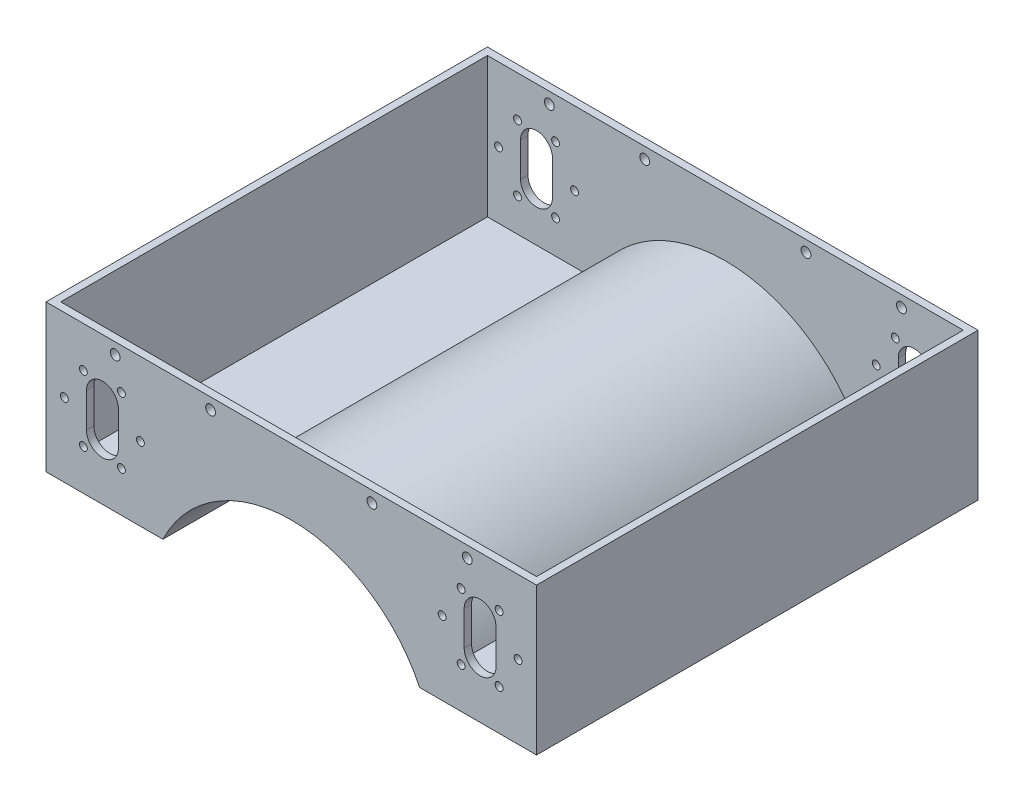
ISO-10303-21;
HEADER;
FILE_DESCRIPTION(('STEP AP214'),'2;1');
FILE_NAME('part.step','',(''),(''),'','','');
FILE_SCHEMA(('AUTOMOTIVE_DESIGN { 1 0 10303 214 1 1 1 1 }'));
ENDSEC;
DATA;
#1=APPLICATION_CONTEXT('core data for automotive mechanical design processes');
#2=APPLICATION_PROTOCOL_DEFINITION('international standard','automotive_design',2000,#1);
#3=PRODUCT_CONTEXT('',#1,'mechanical');
#4=PRODUCT('Part','Part','',(#3));
#5=PRODUCT_RELATED_PRODUCT_CATEGORY('part','',(#4));
#6=PRODUCT_DEFINITION_FORMATION('','',#4);
#7=PRODUCT_DEFINITION_CONTEXT('part definition',#1,'design');
#8=PRODUCT_DEFINITION('design','',#6,#7);
#9=PRODUCT_DEFINITION_SHAPE('','',#8);
#10=(LENGTH_UNIT() NAMED_UNIT(*) SI_UNIT(.MILLI.,.METRE.));
#11=(NAMED_UNIT(*) PLANE_ANGLE_UNIT() SI_UNIT($,.RADIAN.));
#12=(NAMED_UNIT(*) SI_UNIT($,.STERADIAN.) SOLID_ANGLE_UNIT());
#13=UNCERTAINTY_MEASURE_WITH_UNIT(LENGTH_MEASURE(1.E-05),#10,'distance_accuracy_value','');
#14=(GEOMETRIC_REPRESENTATION_CONTEXT(3) GLOBAL_UNCERTAINTY_ASSIGNED_CONTEXT((#13)) GLOBAL_UNIT_ASSIGNED_CONTEXT((#10,
#11,#12)) REPRESENTATION_CONTEXT('',''));
#15=CARTESIAN_POINT('',(0.,0.,0.));
#16=DIRECTION('',(0.,0.,1.));
#17=DIRECTION('',(1.,0.,0.));
#18=AXIS2_PLACEMENT_3D('',#15,#16,#17);
#19=CARTESIAN_POINT('',(0.,0.,0.));
#20=DIRECTION('',(0.,1.,0.));
#21=DIRECTION('',(0.,0.,1.));
#22=AXIS2_PLACEMENT_3D('',#19,#20,#21);
#23=PLANE('',#22);
#24=DIRECTION('',(-1.,0.,0.));
#25=VECTOR('',#24,1.);
#26=CARTESIAN_POINT('',(-100.,0.,-90.));
#27=LINE('',#26,#25);
#28=CARTESIAN_POINT('',(-52.3354564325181,0.,-90.));
#29=VERTEX_POINT('',#28);
#30=CARTESIAN_POINT('',(-100.,0.,-90.));
#31=VERTEX_POINT('',#30);
#32=EDGE_CURVE('E585',#29,#31,#27,.T.);
#33=ORIENTED_EDGE('',*,*,#32,.F.);
#34=DIRECTION('',(0.,0.,1.));
#35=VECTOR('',#34,1.);
#36=CARTESIAN_POINT('',(-52.3354564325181,0.,-910.));
#37=LINE('',#36,#35);
#38=CARTESIAN_POINT('',(-52.3354564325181,0.,90.));
#39=VERTEX_POINT('',#38);
#40=EDGE_CURVE('E616',#29,#39,#37,.T.);
#41=ORIENTED_EDGE('',*,*,#40,.T.);
#42=DIRECTION('',(1.,0.,0.));
#43=VECTOR('',#42,1.);
#44=CARTESIAN_POINT('',(-100.,0.,90.));
#45=LINE('',#44,#43);
#46=CARTESIAN_POINT('',(-100.,0.,90.));
#47=VERTEX_POINT('',#46);
#48=EDGE_CURVE('E572',#47,#39,#45,.T.);
#49=ORIENTED_EDGE('',*,*,#48,.F.);
#50=DIRECTION('',(0.,0.,1.));
#51=VECTOR('',#50,1.);
#52=CARTESIAN_POINT('',(-100.,0.,-90.));
#53=LINE('',#52,#51);
#54=EDGE_CURVE('E590',#31,#47,#53,.T.);
#55=ORIENTED_EDGE('',*,*,#54,.F.);
#56=EDGE_LOOP('',(#33,#41,#49,#55));
#57=FACE_BOUND('',#56,.T.);
#58=ADVANCED_FACE('F45',(#57),#23,.F.);
#59=CARTESIAN_POINT('',(100.,60.,-90.));
#60=DIRECTION('',(-1.,0.,0.));
#61=DIRECTION('',(0.,0.,1.));
#62=AXIS2_PLACEMENT_3D('',#59,#60,#61);
#63=PLANE('',#62);
#64=DIRECTION('',(0.,0.,-1.));
#65=VECTOR('',#64,1.);
#66=CARTESIAN_POINT('',(100.,0.,-90.));
#67=LINE('',#66,#65);
#68=CARTESIAN_POINT('',(100.,0.,90.));
#69=VERTEX_POINT('',#68);
#70=CARTESIAN_POINT('',(100.,0.,-90.));
#71=VERTEX_POINT('',#70);
#72=EDGE_CURVE('E566',#69,#71,#67,.T.);
#73=ORIENTED_EDGE('',*,*,#72,.T.);
#74=DIRECTION('',(0.,-1.,0.));
#75=VECTOR('',#74,1.);
#76=CARTESIAN_POINT('',(100.,60.,-90.));
#77=LINE('',#76,#75);
#78=CARTESIAN_POINT('',(100.,60.,-90.));
#79=VERTEX_POINT('',#78);
#80=EDGE_CURVE('E608',#79,#71,#77,.T.);
#81=ORIENTED_EDGE('',*,*,#80,.F.);
#82=DIRECTION('',(0.,0.,-1.));
#83=VECTOR('',#82,1.);
#84=CARTESIAN_POINT('',(100.,60.,-90.));
#85=LINE('',#84,#83);
#86=CARTESIAN_POINT('',(100.,60.,90.));
#87=VERTEX_POINT('',#86);
#88=EDGE_CURVE('E567',#87,#79,#85,.T.);
#89=ORIENTED_EDGE('',*,*,#88,.F.);
#90=DIRECTION('',(0.,-1.,0.));
#91=VECTOR('',#90,1.);
#92=CARTESIAN_POINT('',(100.,60.,90.));
#93=LINE('',#92,#91);
#94=EDGE_CURVE('E581',#87,#69,#93,.T.);
#95=ORIENTED_EDGE('',*,*,#94,.T.);
#96=EDGE_LOOP('',(#73,#81,#89,#95));
#97=FACE_BOUND('',#96,.T.);
#98=ADVANCED_FACE('F47',(#97),#63,.F.);
#99=CARTESIAN_POINT('',(-100.,60.,-90.));
#100=DIRECTION('',(0.,0.,1.));
#101=DIRECTION('',(1.,0.,0.));
#102=AXIS2_PLACEMENT_3D('',#99,#100,#101);
#103=PLANE('',#102);
#104=CARTESIAN_POINT('',(71.7934583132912,55.4155751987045,-90.));
#105=DIRECTION('',(0.,0.,-1.));
#106=DIRECTION('',(-1.,0.,0.));
#107=AXIS2_PLACEMENT_3D('',#104,#105,#106);
#108=CIRCLE('',#107,1.99999999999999);
#109=CARTESIAN_POINT('',(69.7934583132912,55.4155751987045,-90.));
#110=VERTEX_POINT('',#109);
#111=EDGE_CURVE('E709',#110,#110,#108,.T.);
#112=ORIENTED_EDGE('',*,*,#111,.F.);
#113=EDGE_LOOP('',(#112));
#114=FACE_BOUND('',#113,.T.);
#115=CARTESIAN_POINT('',(32.8831890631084,55.4155751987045,-90.));
#116=DIRECTION('',(0.,0.,-1.));
#117=DIRECTION('',(-1.,0.,0.));
#118=AXIS2_PLACEMENT_3D('',#115,#116,#117);
#119=CIRCLE('',#118,2.);
#120=CARTESIAN_POINT('',(30.8831890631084,55.4155751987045,-90.));
#121=VERTEX_POINT('',#120);
#122=EDGE_CURVE('E717',#121,#121,#119,.T.);
#123=ORIENTED_EDGE('',*,*,#122,.F.);
#124=EDGE_LOOP('',(#123));
#125=FACE_BOUND('',#124,.T.);
#126=CARTESIAN_POINT('',(-71.7934583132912,55.4155751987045,-90.));
#127=DIRECTION('',(0.,0.,1.));
#128=DIRECTION('',(1.,0.,0.));
#129=AXIS2_PLACEMENT_3D('',#126,#127,#128);
#130=CIRCLE('',#129,1.99999999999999);
#131=CARTESIAN_POINT('',(-69.7934583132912,55.4155751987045,-90.));
#132=VERTEX_POINT('',#131);
#133=EDGE_CURVE('E702',#132,#132,#130,.T.);
#134=ORIENTED_EDGE('',*,*,#133,.T.);
#135=EDGE_LOOP('',(#134));
#136=FACE_BOUND('',#135,.T.);
#137=CARTESIAN_POINT('',(-32.8831890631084,55.4155751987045,-90.));
#138=DIRECTION('',(0.,0.,1.));
#139=DIRECTION('',(1.,0.,0.));
#140=AXIS2_PLACEMENT_3D('',#137,#138,#139);
#141=CIRCLE('',#140,2.);
#142=CARTESIAN_POINT('',(-30.8831890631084,55.4155751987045,-90.));
#143=VERTEX_POINT('',#142);
#144=EDGE_CURVE('E715',#143,#143,#141,.T.);
#145=ORIENTED_EDGE('',*,*,#144,.T.);
#146=EDGE_LOOP('',(#145));
#147=FACE_BOUND('',#146,.T.);
#148=CARTESIAN_POINT('',(92.5000000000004,30.0000000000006,-90.));
#149=DIRECTION('',(0.,0.,1.));
#150=DIRECTION('',(1.,0.,0.));
#151=AXIS2_PLACEMENT_3D('',#148,#149,#150);
#152=CIRCLE('',#151,1.6);
#153=CARTESIAN_POINT('',(94.1000000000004,30.0000000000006,-90.));
#154=VERTEX_POINT('',#153);
#155=EDGE_CURVE('E490',#154,#154,#152,.T.);
#156=ORIENTED_EDGE('',*,*,#155,.T.);
#157=EDGE_LOOP('',(#156));
#158=FACE_BOUND('',#157,.T.);
#159=DIRECTION('',(-6.27751933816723E-06,-0.999999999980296,0.));
#160=VECTOR('',#159,1.);
#161=CARTESIAN_POINT('',(70.5002322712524,59.9989296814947,-90.));
#162=LINE('',#161,#160);
#163=CARTESIAN_POINT('',(70.5000876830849,36.9662380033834,-90.));
#164=VERTEX_POINT('',#163);
#165=CARTESIAN_POINT('',(70.5000000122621,23.0003992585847,-90.));
#166=VERTEX_POINT('',#165);
#167=EDGE_CURVE('E473',#164,#166,#162,.T.);
#168=ORIENTED_EDGE('',*,*,#167,.T.);
#169=CARTESIAN_POINT('',(77.,23.,-90.));
#170=DIRECTION('',(0.,0.,1.));
#171=DIRECTION('',(1.,0.,0.));
#172=AXIS2_PLACEMENT_3D('',#169,#170,#171);
#173=CIRCLE('',#172,6.49999999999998);
#174=CARTESIAN_POINT('',(83.5,23.,-90.));
#175=VERTEX_POINT('',#174);
#176=EDGE_CURVE('E481',#166,#175,#173,.T.);
#177=ORIENTED_EDGE('',*,*,#176,.T.);
#178=DIRECTION('',(0.,1.,0.));
#179=VECTOR('',#178,1.);
#180=CARTESIAN_POINT('',(83.5,60.,-90.));
#181=LINE('',#180,#179);
#182=CARTESIAN_POINT('',(83.5,37.,-90.));
#183=VERTEX_POINT('',#182);
#184=EDGE_CURVE('E459',#175,#183,#181,.T.);
#185=ORIENTED_EDGE('',*,*,#184,.T.);
#186=CARTESIAN_POINT('',(77.,37.,-90.));
#187=DIRECTION('',(0.,0.,1.));
#188=DIRECTION('',(1.,0.,0.));
#189=AXIS2_PLACEMENT_3D('',#186,#187,#188);
#190=CIRCLE('',#189,6.49999999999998);
#191=EDGE_CURVE('E466',#183,#164,#190,.T.);
#192=ORIENTED_EDGE('',*,*,#191,.T.);
#193=EDGE_LOOP('',(#168,#177,#185,#192));
#194=FACE_BOUND('',#193,.T.);
#195=DIRECTION('',(-6.27751933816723E-06,0.999999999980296,0.));
#196=VECTOR('',#195,1.);
#197=CARTESIAN_POINT('',(-70.5002322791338,60.0001851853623,-90.));
#198=LINE('',#197,#196);
#199=CARTESIAN_POINT('',(-70.5000000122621,23.0003992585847,-90.));
#200=VERTEX_POINT('',#199);
#201=CARTESIAN_POINT('',(-70.5000876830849,36.9662380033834,-90.));
#202=VERTEX_POINT('',#201);
#203=EDGE_CURVE('E444',#200,#202,#198,.T.);
#204=ORIENTED_EDGE('',*,*,#203,.T.);
#205=CARTESIAN_POINT('',(-77.,37.,-90.));
#206=DIRECTION('',(0.,0.,1.));
#207=DIRECTION('',(1.,0.,0.));
#208=AXIS2_PLACEMENT_3D('',#205,#206,#207);
#209=CIRCLE('',#208,6.49999999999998);
#210=CARTESIAN_POINT('',(-83.5,37.,-90.));
#211=VERTEX_POINT('',#210);
#212=EDGE_CURVE('E452',#202,#211,#209,.T.);
#213=ORIENTED_EDGE('',*,*,#212,.T.);
#214=DIRECTION('',(0.,-1.,0.));
#215=VECTOR('',#214,1.);
#216=CARTESIAN_POINT('',(-83.5,60.,-90.));
#217=LINE('',#216,#215);
#218=CARTESIAN_POINT('',(-83.5,23.,-90.));
#219=VERTEX_POINT('',#218);
#220=EDGE_CURVE('E430',#211,#219,#217,.T.);
#221=ORIENTED_EDGE('',*,*,#220,.T.);
#222=CARTESIAN_POINT('',(-77.,23.,-90.));
#223=DIRECTION('',(0.,0.,1.));
#224=DIRECTION('',(1.,0.,0.));
#225=AXIS2_PLACEMENT_3D('',#222,#223,#224);
#226=CIRCLE('',#225,6.49999999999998);
#227=EDGE_CURVE('E437',#219,#200,#226,.T.);
#228=ORIENTED_EDGE('',*,*,#227,.T.);
#229=EDGE_LOOP('',(#204,#213,#221,#228));
#230=FACE_BOUND('',#229,.T.);
#231=CARTESIAN_POINT('',(-92.5000000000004,30.0000000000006,-90.));
#232=DIRECTION('',(0.,0.,1.));
#233=DIRECTION('',(1.,0.,0.));
#234=AXIS2_PLACEMENT_3D('',#231,#232,#233);
#235=CIRCLE('',#234,1.6);
#236=CARTESIAN_POINT('',(-90.9000000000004,30.0000000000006,-90.));
#237=VERTEX_POINT('',#236);
#238=EDGE_CURVE('E423',#237,#237,#235,.T.);
#239=ORIENTED_EDGE('',*,*,#238,.T.);
#240=EDGE_LOOP('',(#239));
#241=FACE_BOUND('',#240,.T.);
#242=CARTESIAN_POINT('',(-84.7500000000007,16.5766062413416,-90.));
#243=DIRECTION('',(0.,0.,1.));
#244=DIRECTION('',(1.,0.,0.));
#245=AXIS2_PLACEMENT_3D('',#242,#243,#244);
#246=CIRCLE('',#245,1.6);
#247=CARTESIAN_POINT('',(-83.1500000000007,16.5766062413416,-90.));
#248=VERTEX_POINT('',#247);
#249=EDGE_CURVE('E414',#248,#248,#246,.T.);
#250=ORIENTED_EDGE('',*,*,#249,.T.);
#251=EDGE_LOOP('',(#250));
#252=FACE_BOUND('',#251,.T.);
#253=CARTESIAN_POINT('',(-69.2500000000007,16.5766062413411,-90.));
#254=DIRECTION('',(0.,0.,1.));
#255=DIRECTION('',(1.,0.,0.));
#256=AXIS2_PLACEMENT_3D('',#253,#254,#255);
#257=CIRCLE('',#256,1.6);
#258=CARTESIAN_POINT('',(-67.6500000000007,16.5766062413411,-90.));
#259=VERTEX_POINT('',#258);
#260=EDGE_CURVE('E405',#259,#259,#257,.T.);
#261=ORIENTED_EDGE('',*,*,#260,.T.);
#262=EDGE_LOOP('',(#261));
#263=FACE_BOUND('',#262,.T.);
#264=CARTESIAN_POINT('',(-61.5000000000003,30.,-90.));
#265=DIRECTION('',(0.,0.,1.));
#266=DIRECTION('',(1.,0.,0.));
#267=AXIS2_PLACEMENT_3D('',#264,#265,#266);
#268=CIRCLE('',#267,1.6);
#269=CARTESIAN_POINT('',(-59.9000000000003,30.,-90.));
#270=VERTEX_POINT('',#269);
#271=EDGE_CURVE('E396',#270,#270,#268,.T.);
#272=ORIENTED_EDGE('',*,*,#271,.T.);
#273=EDGE_LOOP('',(#272));
#274=FACE_BOUND('',#273,.T.);
#275=CARTESIAN_POINT('',(-69.25,43.4233937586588,-90.));
#276=DIRECTION('',(0.,0.,1.));
#277=DIRECTION('',(1.,0.,0.));
#278=AXIS2_PLACEMENT_3D('',#275,#276,#277);
#279=CIRCLE('',#278,1.60000000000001);
#280=CARTESIAN_POINT('',(-67.65,43.4233937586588,-90.));
#281=VERTEX_POINT('',#280);
#282=EDGE_CURVE('E387',#281,#281,#279,.T.);
#283=ORIENTED_EDGE('',*,*,#282,.T.);
#284=EDGE_LOOP('',(#283));
#285=FACE_BOUND('',#284,.T.);
#286=CARTESIAN_POINT('',(84.75,43.4233937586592,-90.));
#287=DIRECTION('',(0.,0.,1.));
#288=DIRECTION('',(1.,0.,0.));
#289=AXIS2_PLACEMENT_3D('',#286,#287,#288);
#290=CIRCLE('',#289,1.60000000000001);
#291=CARTESIAN_POINT('',(86.35,43.4233937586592,-90.));
#292=VERTEX_POINT('',#291);
#293=EDGE_CURVE('E378',#292,#292,#290,.T.);
#294=ORIENTED_EDGE('',*,*,#293,.T.);
#295=EDGE_LOOP('',(#294));
#296=FACE_BOUND('',#295,.T.);
#297=CARTESIAN_POINT('',(69.25,43.4233937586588,-90.));
#298=DIRECTION('',(0.,0.,1.));
#299=DIRECTION('',(1.,0.,0.));
#300=AXIS2_PLACEMENT_3D('',#297,#298,#299);
#301=CIRCLE('',#300,1.60000000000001);
#302=CARTESIAN_POINT('',(70.85,43.4233937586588,-90.));
#303=VERTEX_POINT('',#302);
#304=EDGE_CURVE('E369',#303,#303,#301,.T.);
#305=ORIENTED_EDGE('',*,*,#304,.T.);
#306=EDGE_LOOP('',(#305));
#307=FACE_BOUND('',#306,.T.);
#308=CARTESIAN_POINT('',(61.5000000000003,30.,-90.));
#309=DIRECTION('',(0.,0.,1.));
#310=DIRECTION('',(1.,0.,0.));
#311=AXIS2_PLACEMENT_3D('',#308,#309,#310);
#312=CIRCLE('',#311,1.6);
#313=CARTESIAN_POINT('',(63.1000000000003,30.,-90.));
#314=VERTEX_POINT('',#313);
#315=EDGE_CURVE('E360',#314,#314,#312,.T.);
#316=ORIENTED_EDGE('',*,*,#315,.T.);
#317=EDGE_LOOP('',(#316));
#318=FACE_BOUND('',#317,.T.);
#319=CARTESIAN_POINT('',(69.2500000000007,16.5766062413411,-90.));
#320=DIRECTION('',(0.,0.,1.));
#321=DIRECTION('',(1.,0.,0.));
#322=AXIS2_PLACEMENT_3D('',#319,#320,#321);
#323=CIRCLE('',#322,1.6);
#324=CARTESIAN_POINT('',(70.8500000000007,16.5766062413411,-90.));
#325=VERTEX_POINT('',#324);
#326=EDGE_CURVE('E351',#325,#325,#323,.T.);
#327=ORIENTED_EDGE('',*,*,#326,.T.);
#328=EDGE_LOOP('',(#327));
#329=FACE_BOUND('',#328,.T.);
#330=CARTESIAN_POINT('',(84.7500000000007,16.5766062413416,-90.));
#331=DIRECTION('',(0.,0.,1.));
#332=DIRECTION('',(1.,0.,0.));
#333=AXIS2_PLACEMENT_3D('',#330,#331,#332);
#334=CIRCLE('',#333,1.6);
#335=CARTESIAN_POINT('',(86.3500000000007,16.5766062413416,-90.));
#336=VERTEX_POINT('',#335);
#337=EDGE_CURVE('E342',#336,#336,#334,.T.);
#338=ORIENTED_EDGE('',*,*,#337,.T.);
#339=EDGE_LOOP('',(#338));
#340=FACE_BOUND('',#339,.T.);
#341=CARTESIAN_POINT('',(-84.75,43.4233937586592,-90.));
#342=DIRECTION('',(0.,0.,1.));
#343=DIRECTION('',(1.,0.,0.));
#344=AXIS2_PLACEMENT_3D('',#341,#342,#343);
#345=CIRCLE('',#344,1.60000000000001);
#346=CARTESIAN_POINT('',(-83.15,43.4233937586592,-90.));
#347=VERTEX_POINT('',#346);
#348=EDGE_CURVE('E333',#347,#347,#345,.T.);
#349=ORIENTED_EDGE('',*,*,#348,.T.);
#350=EDGE_LOOP('',(#349));
#351=FACE_BOUND('',#350,.T.);
#352=CARTESIAN_POINT('',(52.3354564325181,0.,-90.));
#353=VERTEX_POINT('',#352);
#354=EDGE_CURVE('E586',#71,#353,#27,.T.);
#355=ORIENTED_EDGE('',*,*,#354,.T.);
#356=CARTESIAN_POINT('',(0.,-25.,-90.));
#357=DIRECTION('',(0.,0.,1.));
#358=DIRECTION('',(1.,0.,0.));
#359=AXIS2_PLACEMENT_3D('',#356,#357,#358);
#360=CIRCLE('',#359,58.);
#361=EDGE_CURVE('E562',#353,#29,#360,.T.);
#362=ORIENTED_EDGE('',*,*,#361,.T.);
#363=ORIENTED_EDGE('',*,*,#32,.T.);
#364=DIRECTION('',(0.,-1.,0.));
#365=VECTOR('',#364,1.);
#366=CARTESIAN_POINT('',(-100.,60.,-90.));
#367=LINE('',#366,#365);
#368=CARTESIAN_POINT('',(-100.,60.,-90.));
#369=VERTEX_POINT('',#368);
#370=EDGE_CURVE('E604',#369,#31,#367,.T.);
#371=ORIENTED_EDGE('',*,*,#370,.F.);
#372=DIRECTION('',(-1.,0.,0.));
#373=VECTOR('',#372,1.);
#374=CARTESIAN_POINT('',(-100.,60.,-90.));
#375=LINE('',#374,#373);
#376=EDGE_CURVE('E571',#79,#369,#375,.T.);
#377=ORIENTED_EDGE('',*,*,#376,.F.);
#378=ORIENTED_EDGE('',*,*,#80,.T.);
#379=EDGE_LOOP('',(#355,#362,#363,#371,#377,#378));
#380=FACE_BOUND('',#379,.T.);
#381=ADVANCED_FACE('F854',(#114,#125,#136,#147,#158,#194,#230,#241,#252,#263,#274,#285,#296,
#307,#318,#329,#340,#351,#380),#103,.F.);
#382=CARTESIAN_POINT('',(-100.,60.,-90.));
#383=DIRECTION('',(1.,0.,0.));
#384=DIRECTION('',(0.,0.,-1.));
#385=AXIS2_PLACEMENT_3D('',#382,#383,#384);
#386=PLANE('',#385);
#387=ORIENTED_EDGE('',*,*,#54,.T.);
#388=DIRECTION('',(0.,-1.,0.));
#389=VECTOR('',#388,1.);
#390=CARTESIAN_POINT('',(-100.,60.,90.));
#391=LINE('',#390,#389);
#392=CARTESIAN_POINT('',(-100.,60.,90.));
#393=VERTEX_POINT('',#392);
#394=EDGE_CURVE('E600',#393,#47,#391,.T.);
#395=ORIENTED_EDGE('',*,*,#394,.F.);
#396=DIRECTION('',(0.,0.,1.));
#397=VECTOR('',#396,1.);
#398=CARTESIAN_POINT('',(-100.,60.,-90.));
#399=LINE('',#398,#397);
#400=EDGE_CURVE('E575',#369,#393,#399,.T.);
#401=ORIENTED_EDGE('',*,*,#400,.F.);
#402=ORIENTED_EDGE('',*,*,#370,.T.);
#403=EDGE_LOOP('',(#387,#395,#401,#402));
#404=FACE_BOUND('',#403,.T.);
#405=ADVANCED_FACE('F879',(#404),#386,.F.);
#406=CARTESIAN_POINT('',(-100.,60.,90.));
#407=DIRECTION('',(0.,0.,-1.));
#408=DIRECTION('',(-1.,0.,0.));
#409=AXIS2_PLACEMENT_3D('',#406,#407,#408);
#410=PLANE('',#409);
#411=CARTESIAN_POINT('',(71.7934583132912,55.4155751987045,90.));
#412=DIRECTION('',(0.,0.,-1.));
#413=DIRECTION('',(-1.,0.,0.));
#414=AXIS2_PLACEMENT_3D('',#411,#412,#413);
#415=CIRCLE('',#414,1.99999999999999);
#416=CARTESIAN_POINT('',(69.7934583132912,55.4155751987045,90.));
#417=VERTEX_POINT('',#416);
#418=EDGE_CURVE('E692',#417,#417,#415,.T.);
#419=ORIENTED_EDGE('',*,*,#418,.T.);
#420=EDGE_LOOP('',(#419));
#421=FACE_BOUND('',#420,.T.);
#422=CARTESIAN_POINT('',(32.8831890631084,55.4155751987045,90.));
#423=DIRECTION('',(0.,0.,-1.));
#424=DIRECTION('',(-1.,0.,0.));
#425=AXIS2_PLACEMENT_3D('',#422,#423,#424);
#426=CIRCLE('',#425,2.);
#427=CARTESIAN_POINT('',(30.8831890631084,55.4155751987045,90.));
#428=VERTEX_POINT('',#427);
#429=EDGE_CURVE('E705',#428,#428,#426,.T.);
#430=ORIENTED_EDGE('',*,*,#429,.T.);
#431=EDGE_LOOP('',(#430));
#432=FACE_BOUND('',#431,.T.);
#433=CARTESIAN_POINT('',(-71.7934583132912,55.4155751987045,90.));
#434=DIRECTION('',(0.,0.,1.));
#435=DIRECTION('',(1.,0.,0.));
#436=AXIS2_PLACEMENT_3D('',#433,#434,#435);
#437=CIRCLE('',#436,1.99999999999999);
#438=CARTESIAN_POINT('',(-69.7934583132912,55.4155751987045,90.));
#439=VERTEX_POINT('',#438);
#440=EDGE_CURVE('E682',#439,#439,#437,.T.);
#441=ORIENTED_EDGE('',*,*,#440,.F.);
#442=EDGE_LOOP('',(#441));
#443=FACE_BOUND('',#442,.T.);
#444=CARTESIAN_POINT('',(-32.8831890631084,55.4155751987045,90.));
#445=DIRECTION('',(0.,0.,1.));
#446=DIRECTION('',(1.,0.,0.));
#447=AXIS2_PLACEMENT_3D('',#444,#445,#446);
#448=CIRCLE('',#447,2.);
#449=CARTESIAN_POINT('',(-30.8831890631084,55.4155751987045,90.));
#450=VERTEX_POINT('',#449);
#451=EDGE_CURVE('E696',#450,#450,#448,.T.);
#452=ORIENTED_EDGE('',*,*,#451,.F.);
#453=EDGE_LOOP('',(#452));
#454=FACE_BOUND('',#453,.T.);
#455=CARTESIAN_POINT('',(92.5000000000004,30.0000000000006,90.));
#456=DIRECTION('',(0.,0.,1.));
#457=DIRECTION('',(-1.,0.,0.));
#458=AXIS2_PLACEMENT_3D('',#455,#456,#457);
#459=CIRCLE('',#458,1.6);
#460=CARTESIAN_POINT('',(90.9000000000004,30.0000000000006,90.));
#461=VERTEX_POINT('',#460);
#462=EDGE_CURVE('E290',#461,#461,#459,.T.);
#463=ORIENTED_EDGE('',*,*,#462,.F.);
#464=EDGE_LOOP('',(#463));
#465=FACE_BOUND('',#464,.T.);
#466=DIRECTION('',(0.,1.,0.));
#467=VECTOR('',#466,1.);
#468=CARTESIAN_POINT('',(83.5,37.,90.));
#469=LINE('',#468,#467);
#470=CARTESIAN_POINT('',(83.5,23.,90.));
#471=VERTEX_POINT('',#470);
#472=CARTESIAN_POINT('',(83.5,37.,90.));
#473=VERTEX_POINT('',#472);
#474=EDGE_CURVE('E299',#471,#473,#469,.T.);
#475=ORIENTED_EDGE('',*,*,#474,.F.);
#476=CARTESIAN_POINT('',(77.,23.,90.));
#477=DIRECTION('',(0.,0.,1.));
#478=DIRECTION('',(-1.,0.,0.));
#479=AXIS2_PLACEMENT_3D('',#476,#477,#478);
#480=CIRCLE('',#479,6.49999999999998);
#481=CARTESIAN_POINT('',(70.5000000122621,23.0003992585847,90.));
#482=VERTEX_POINT('',#481);
#483=EDGE_CURVE('E244',#482,#471,#480,.T.);
#484=ORIENTED_EDGE('',*,*,#483,.F.);
#485=DIRECTION('',(-6.27751933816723E-06,-0.999999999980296,0.));
#486=VECTOR('',#485,1.);
#487=CARTESIAN_POINT('',(70.5000876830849,36.9662380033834,90.));
#488=LINE('',#487,#486);
#489=CARTESIAN_POINT('',(70.5000876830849,36.9662380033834,90.));
#490=VERTEX_POINT('',#489);
#491=EDGE_CURVE('E291',#490,#482,#488,.T.);
#492=ORIENTED_EDGE('',*,*,#491,.F.);
#493=CARTESIAN_POINT('',(77.,37.,90.));
#494=DIRECTION('',(0.,0.,1.));
#495=DIRECTION('',(-1.,0.,0.));
#496=AXIS2_PLACEMENT_3D('',#493,#494,#495);
#497=CIRCLE('',#496,6.49999999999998);
#498=EDGE_CURVE('E295',#473,#490,#497,.T.);
#499=ORIENTED_EDGE('',*,*,#498,.F.);
#500=EDGE_LOOP('',(#475,#484,#492,#499));
#501=FACE_BOUND('',#500,.T.);
#502=DIRECTION('',(0.,-1.,0.));
#503=VECTOR('',#502,1.);
#504=CARTESIAN_POINT('',(-83.5,37.,90.));
#505=LINE('',#504,#503);
#506=CARTESIAN_POINT('',(-83.5,37.,90.));
#507=VERTEX_POINT('',#506);
#508=CARTESIAN_POINT('',(-83.5,23.,90.));
#509=VERTEX_POINT('',#508);
#510=EDGE_CURVE('E262',#507,#509,#505,.T.);
#511=ORIENTED_EDGE('',*,*,#510,.F.);
#512=CARTESIAN_POINT('',(-77.,37.,90.));
#513=DIRECTION('',(0.,0.,1.));
#514=DIRECTION('',(1.,0.,0.));
#515=AXIS2_PLACEMENT_3D('',#512,#513,#514);
#516=CIRCLE('',#515,6.49999999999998);
#517=CARTESIAN_POINT('',(-70.5000876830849,36.9662380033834,90.));
#518=VERTEX_POINT('',#517);
#519=EDGE_CURVE('E236',#518,#507,#516,.T.);
#520=ORIENTED_EDGE('',*,*,#519,.F.);
#521=DIRECTION('',(-6.27751933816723E-06,0.999999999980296,0.));
#522=VECTOR('',#521,1.);
#523=CARTESIAN_POINT('',(-70.5000876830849,36.9662380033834,90.));
#524=LINE('',#523,#522);
#525=CARTESIAN_POINT('',(-70.5000000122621,23.0003992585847,90.));
#526=VERTEX_POINT('',#525);
#527=EDGE_CURVE('E247',#526,#518,#524,.T.);
#528=ORIENTED_EDGE('',*,*,#527,.F.);
#529=CARTESIAN_POINT('',(-77.,23.,90.));
#530=DIRECTION('',(0.,0.,1.));
#531=DIRECTION('',(1.,0.,0.));
#532=AXIS2_PLACEMENT_3D('',#529,#530,#531);
#533=CIRCLE('',#532,6.49999999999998);
#534=EDGE_CURVE('E255',#509,#526,#533,.T.);
#535=ORIENTED_EDGE('',*,*,#534,.F.);
#536=EDGE_LOOP('',(#511,#520,#528,#535));
#537=FACE_BOUND('',#536,.T.);
#538=CARTESIAN_POINT('',(-92.5000000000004,30.0000000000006,90.));
#539=DIRECTION('',(0.,0.,1.));
#540=DIRECTION('',(1.,0.,0.));
#541=AXIS2_PLACEMENT_3D('',#538,#539,#540);
#542=CIRCLE('',#541,1.6);
#543=CARTESIAN_POINT('',(-90.9000000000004,30.0000000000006,90.));
#544=VERTEX_POINT('',#543);
#545=EDGE_CURVE('E264',#544,#544,#542,.T.);
#546=ORIENTED_EDGE('',*,*,#545,.F.);
#547=EDGE_LOOP('',(#546));
#548=FACE_BOUND('',#547,.T.);
#549=CARTESIAN_POINT('',(-84.7500000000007,16.5766062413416,90.));
#550=DIRECTION('',(0.,0.,1.));
#551=DIRECTION('',(1.,0.,0.));
#552=AXIS2_PLACEMENT_3D('',#549,#550,#551);
#553=CIRCLE('',#552,1.6);
#554=CARTESIAN_POINT('',(-83.1500000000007,16.5766062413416,90.));
#555=VERTEX_POINT('',#554);
#556=EDGE_CURVE('E269',#555,#555,#553,.T.);
#557=ORIENTED_EDGE('',*,*,#556,.F.);
#558=EDGE_LOOP('',(#557));
#559=FACE_BOUND('',#558,.T.);
#560=CARTESIAN_POINT('',(-69.2500000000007,16.5766062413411,90.));
#561=DIRECTION('',(0.,0.,1.));
#562=DIRECTION('',(1.,0.,0.));
#563=AXIS2_PLACEMENT_3D('',#560,#561,#562);
#564=CIRCLE('',#563,1.6);
#565=CARTESIAN_POINT('',(-67.6500000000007,16.5766062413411,90.));
#566=VERTEX_POINT('',#565);
#567=EDGE_CURVE('E318',#566,#566,#564,.T.);
#568=ORIENTED_EDGE('',*,*,#567,.F.);
#569=EDGE_LOOP('',(#568));
#570=FACE_BOUND('',#569,.T.);
#571=CARTESIAN_POINT('',(-61.5000000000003,30.,90.));
#572=DIRECTION('',(0.,0.,1.));
#573=DIRECTION('',(1.,0.,0.));
#574=AXIS2_PLACEMENT_3D('',#571,#572,#573);
#575=CIRCLE('',#574,1.6);
#576=CARTESIAN_POINT('',(-59.9000000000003,30.,90.));
#577=VERTEX_POINT('',#576);
#578=EDGE_CURVE('E314',#577,#577,#575,.T.);
#579=ORIENTED_EDGE('',*,*,#578,.F.);
#580=EDGE_LOOP('',(#579));
#581=FACE_BOUND('',#580,.T.);
#582=CARTESIAN_POINT('',(-69.25,43.4233937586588,90.));
#583=DIRECTION('',(0.,0.,1.));
#584=DIRECTION('',(1.,0.,0.));
#585=AXIS2_PLACEMENT_3D('',#582,#583,#584);
#586=CIRCLE('',#585,1.60000000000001);
#587=CARTESIAN_POINT('',(-67.65,43.4233937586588,90.));
#588=VERTEX_POINT('',#587);
#589=EDGE_CURVE('E309',#588,#588,#586,.T.);
#590=ORIENTED_EDGE('',*,*,#589,.F.);
#591=EDGE_LOOP('',(#590));
#592=FACE_BOUND('',#591,.T.);
#593=CARTESIAN_POINT('',(84.75,43.4233937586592,90.));
#594=DIRECTION('',(0.,0.,1.));
#595=DIRECTION('',(-1.,0.,0.));
#596=AXIS2_PLACEMENT_3D('',#593,#594,#595);
#597=CIRCLE('',#596,1.60000000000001);
#598=CARTESIAN_POINT('',(83.15,43.4233937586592,90.));
#599=VERTEX_POINT('',#598);
#600=EDGE_CURVE('E686',#599,#599,#597,.T.);
#601=ORIENTED_EDGE('',*,*,#600,.F.);
#602=EDGE_LOOP('',(#601));
#603=FACE_BOUND('',#602,.T.);
#604=CARTESIAN_POINT('',(69.25,43.4233937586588,90.));
#605=DIRECTION('',(0.,0.,1.));
#606=DIRECTION('',(-1.,0.,0.));
#607=AXIS2_PLACEMENT_3D('',#604,#605,#606);
#608=CIRCLE('',#607,1.60000000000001);
#609=CARTESIAN_POINT('',(67.65,43.4233937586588,90.));
#610=VERTEX_POINT('',#609);
#611=EDGE_CURVE('E746',#610,#610,#608,.T.);
#612=ORIENTED_EDGE('',*,*,#611,.F.);
#613=EDGE_LOOP('',(#612));
#614=FACE_BOUND('',#613,.T.);
#615=CARTESIAN_POINT('',(61.5000000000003,30.,90.));
#616=DIRECTION('',(0.,0.,1.));
#617=DIRECTION('',(-1.,0.,0.));
#618=AXIS2_PLACEMENT_3D('',#615,#616,#617);
#619=CIRCLE('',#618,1.6);
#620=CARTESIAN_POINT('',(59.9000000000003,30.,90.));
#621=VERTEX_POINT('',#620);
#622=EDGE_CURVE('E754',#621,#621,#619,.T.);
#623=ORIENTED_EDGE('',*,*,#622,.F.);
#624=EDGE_LOOP('',(#623));
#625=FACE_BOUND('',#624,.T.);
#626=CARTESIAN_POINT('',(69.2500000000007,16.5766062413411,90.));
#627=DIRECTION('',(0.,0.,1.));
#628=DIRECTION('',(-1.,0.,0.));
#629=AXIS2_PLACEMENT_3D('',#626,#627,#628);
#630=CIRCLE('',#629,1.6);
#631=CARTESIAN_POINT('',(67.6500000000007,16.5766062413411,90.));
#632=VERTEX_POINT('',#631);
#633=EDGE_CURVE('E750',#632,#632,#630,.T.);
#634=ORIENTED_EDGE('',*,*,#633,.F.);
#635=EDGE_LOOP('',(#634));
#636=FACE_BOUND('',#635,.T.);
#637=CARTESIAN_POINT('',(84.7500000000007,16.5766062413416,90.));
#638=DIRECTION('',(0.,0.,1.));
#639=DIRECTION('',(-1.,0.,0.));
#640=AXIS2_PLACEMENT_3D('',#637,#638,#639);
#641=CIRCLE('',#640,1.6);
#642=CARTESIAN_POINT('',(83.1500000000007,16.5766062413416,90.));
#643=VERTEX_POINT('',#642);
#644=EDGE_CURVE('E308',#643,#643,#641,.T.);
#645=ORIENTED_EDGE('',*,*,#644,.F.);
#646=EDGE_LOOP('',(#645));
#647=FACE_BOUND('',#646,.T.);
#648=CARTESIAN_POINT('',(-84.75,43.4233937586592,90.));
#649=DIRECTION('',(0.,0.,1.));
#650=DIRECTION('',(1.,0.,0.));
#651=AXIS2_PLACEMENT_3D('',#648,#649,#650);
#652=CIRCLE('',#651,1.60000000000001);
#653=CARTESIAN_POINT('',(-83.15,43.4233937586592,90.));
#654=VERTEX_POINT('',#653);
#655=EDGE_CURVE('E313',#654,#654,#652,.T.);
#656=ORIENTED_EDGE('',*,*,#655,.F.);
#657=EDGE_LOOP('',(#656));
#658=FACE_BOUND('',#657,.T.);
#659=ORIENTED_EDGE('',*,*,#48,.T.);
#660=CARTESIAN_POINT('',(0.,-25.,90.));
#661=DIRECTION('',(0.,0.,1.));
#662=DIRECTION('',(1.,0.,0.));
#663=AXIS2_PLACEMENT_3D('',#660,#661,#662);
#664=CIRCLE('',#663,58.);
#665=CARTESIAN_POINT('',(52.3354564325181,0.,90.));
#666=VERTEX_POINT('',#665);
#667=EDGE_CURVE('E504',#666,#39,#664,.T.);
#668=ORIENTED_EDGE('',*,*,#667,.F.);
#669=EDGE_CURVE('E593',#666,#69,#45,.T.);
#670=ORIENTED_EDGE('',*,*,#669,.T.);
#671=ORIENTED_EDGE('',*,*,#94,.F.);
#672=DIRECTION('',(1.,0.,0.));
#673=VECTOR('',#672,1.);
#674=CARTESIAN_POINT('',(-100.,60.,90.));
#675=LINE('',#674,#673);
#676=EDGE_CURVE('E578',#393,#87,#675,.T.);
#677=ORIENTED_EDGE('',*,*,#676,.F.);
#678=ORIENTED_EDGE('',*,*,#394,.T.);
#679=EDGE_LOOP('',(#659,#668,#670,#671,#677,#678));
#680=FACE_BOUND('',#679,.T.);
#681=ADVANCED_FACE('F259',(#421,#432,#443,#454,#465,#501,#537,#548,#559,#570,#581,#592,#603,
#614,#625,#636,#647,#658,#680),#410,.F.);
#682=CARTESIAN_POINT('',(0.,60.,0.));
#683=DIRECTION('',(0.,1.,0.));
#684=DIRECTION('',(0.,0.,1.));
#685=AXIS2_PLACEMENT_3D('',#682,#683,#684);
#686=PLANE('',#685);
#687=DIRECTION('',(0.,0.,-1.));
#688=VECTOR('',#687,1.);
#689=CARTESIAN_POINT('',(97.,60.,-90.));
#690=LINE('',#689,#688);
#691=CARTESIAN_POINT('',(97.,60.,87.));
#692=VERTEX_POINT('',#691);
#693=CARTESIAN_POINT('',(97.,60.,-87.));
#694=VERTEX_POINT('',#693);
#695=EDGE_CURVE('E510',#692,#694,#690,.T.);
#696=ORIENTED_EDGE('',*,*,#695,.F.);
#697=DIRECTION('',(1.,0.,0.));
#698=VECTOR('',#697,1.);
#699=CARTESIAN_POINT('',(-100.,60.,87.));
#700=LINE('',#699,#698);
#701=CARTESIAN_POINT('',(-97.,60.,87.));
#702=VERTEX_POINT('',#701);
#703=EDGE_CURVE('E538',#702,#692,#700,.T.);
#704=ORIENTED_EDGE('',*,*,#703,.F.);
#705=DIRECTION('',(0.,0.,1.));
#706=VECTOR('',#705,1.);
#707=CARTESIAN_POINT('',(-97.,60.,-90.));
#708=LINE('',#707,#706);
#709=CARTESIAN_POINT('',(-97.,60.,-87.));
#710=VERTEX_POINT('',#709);
#711=EDGE_CURVE('E552',#710,#702,#708,.T.);
#712=ORIENTED_EDGE('',*,*,#711,.F.);
#713=DIRECTION('',(-1.,0.,0.));
#714=VECTOR('',#713,1.);
#715=CARTESIAN_POINT('',(-100.,60.,-87.));
#716=LINE('',#715,#714);
#717=EDGE_CURVE('E549',#694,#710,#716,.T.);
#718=ORIENTED_EDGE('',*,*,#717,.F.);
#719=EDGE_LOOP('',(#696,#704,#712,#718));
#720=FACE_BOUND('',#719,.T.);
#721=ORIENTED_EDGE('',*,*,#88,.T.);
#722=ORIENTED_EDGE('',*,*,#376,.T.);
#723=ORIENTED_EDGE('',*,*,#400,.T.);
#724=ORIENTED_EDGE('',*,*,#676,.T.);
#725=EDGE_LOOP('',(#721,#722,#723,#724));
#726=FACE_BOUND('',#725,.T.);
#727=ADVANCED_FACE('F820',(#720,#726),#686,.T.);
#728=ORIENTED_EDGE('',*,*,#669,.F.);
#729=DIRECTION('',(0.,0.,1.));
#730=VECTOR('',#729,1.);
#731=CARTESIAN_POINT('',(52.3354564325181,0.,-910.));
#732=LINE('',#731,#730);
#733=EDGE_CURVE('E612',#666,#353,#732,.F.);
#734=ORIENTED_EDGE('',*,*,#733,.T.);
#735=ORIENTED_EDGE('',*,*,#354,.F.);
#736=ORIENTED_EDGE('',*,*,#72,.F.);
#737=EDGE_LOOP('',(#728,#734,#735,#736));
#738=FACE_BOUND('',#737,.T.);
#739=ADVANCED_FACE('F848',(#738),#23,.F.);
#740=CARTESIAN_POINT('',(0.,-25.,-910.));
#741=DIRECTION('',(0.,0.,1.));
#742=DIRECTION('',(1.,0.,0.));
#743=AXIS2_PLACEMENT_3D('',#740,#741,#742);
#744=CYLINDRICAL_SURFACE('',#743,58.);
#745=ORIENTED_EDGE('',*,*,#361,.F.);
#746=ORIENTED_EDGE('',*,*,#733,.F.);
#747=ORIENTED_EDGE('',*,*,#667,.T.);
#748=ORIENTED_EDGE('',*,*,#40,.F.);
#749=EDGE_LOOP('',(#745,#746,#747,#748));
#750=FACE_BOUND('',#749,.T.);
#751=ADVANCED_FACE('F859',(#750),#744,.F.);
#752=CARTESIAN_POINT('',(0.,3.,0.));
#753=DIRECTION('',(0.,1.,0.));
#754=DIRECTION('',(0.,0.,1.));
#755=AXIS2_PLACEMENT_3D('',#752,#753,#754);
#756=PLANE('',#755);
#757=DIRECTION('',(-1.,0.,0.));
#758=VECTOR('',#757,1.);
#759=CARTESIAN_POINT('',(-100.,3.,-87.));
#760=LINE('',#759,#758);
#761=CARTESIAN_POINT('',(-54.1940956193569,3.,-87.));
#762=VERTEX_POINT('',#761);
#763=CARTESIAN_POINT('',(-97.,3.,-87.));
#764=VERTEX_POINT('',#763);
#765=EDGE_CURVE('E495',#762,#764,#760,.T.);
#766=ORIENTED_EDGE('',*,*,#765,.T.);
#767=DIRECTION('',(0.,0.,1.));
#768=VECTOR('',#767,1.);
#769=CARTESIAN_POINT('',(-97.,3.,-90.));
#770=LINE('',#769,#768);
#771=CARTESIAN_POINT('',(-97.,3.,87.));
#772=VERTEX_POINT('',#771);
#773=EDGE_CURVE('E512',#764,#772,#770,.T.);
#774=ORIENTED_EDGE('',*,*,#773,.T.);
#775=DIRECTION('',(1.,0.,0.));
#776=VECTOR('',#775,1.);
#777=CARTESIAN_POINT('',(-100.,3.,87.));
#778=LINE('',#777,#776);
#779=CARTESIAN_POINT('',(-54.1940956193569,3.,87.));
#780=VERTEX_POINT('',#779);
#781=EDGE_CURVE('E506',#772,#780,#778,.T.);
#782=ORIENTED_EDGE('',*,*,#781,.T.);
#783=DIRECTION('',(0.,0.,1.));
#784=VECTOR('',#783,1.);
#785=CARTESIAN_POINT('',(-54.1940956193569,3.,-87.));
#786=LINE('',#785,#784);
#787=EDGE_CURVE('E500',#762,#780,#786,.T.);
#788=ORIENTED_EDGE('',*,*,#787,.F.);
#789=EDGE_LOOP('',(#766,#774,#782,#788));
#790=FACE_BOUND('',#789,.T.);
#791=ADVANCED_FACE('F810',(#790),#756,.T.);
#792=CARTESIAN_POINT('',(97.,60.,-90.));
#793=DIRECTION('',(-1.,0.,0.));
#794=DIRECTION('',(0.,0.,1.));
#795=AXIS2_PLACEMENT_3D('',#792,#793,#794);
#796=PLANE('',#795);
#797=DIRECTION('',(0.,0.,-1.));
#798=VECTOR('',#797,1.);
#799=CARTESIAN_POINT('',(97.,3.,-90.));
#800=LINE('',#799,#798);
#801=CARTESIAN_POINT('',(97.,3.,87.));
#802=VERTEX_POINT('',#801);
#803=CARTESIAN_POINT('',(97.,3.,-87.));
#804=VERTEX_POINT('',#803);
#805=EDGE_CURVE('E499',#802,#804,#800,.T.);
#806=ORIENTED_EDGE('',*,*,#805,.F.);
#807=DIRECTION('',(0.,-1.,0.));
#808=VECTOR('',#807,1.);
#809=CARTESIAN_POINT('',(97.,60.,87.));
#810=LINE('',#809,#808);
#811=EDGE_CURVE('E534',#692,#802,#810,.T.);
#812=ORIENTED_EDGE('',*,*,#811,.F.);
#813=ORIENTED_EDGE('',*,*,#695,.T.);
#814=DIRECTION('',(0.,-1.,0.));
#815=VECTOR('',#814,1.);
#816=CARTESIAN_POINT('',(97.,60.,-87.));
#817=LINE('',#816,#815);
#818=EDGE_CURVE('E526',#694,#804,#817,.T.);
#819=ORIENTED_EDGE('',*,*,#818,.T.);
#820=EDGE_LOOP('',(#806,#812,#813,#819));
#821=FACE_BOUND('',#820,.T.);
#822=ADVANCED_FACE('F825',(#821),#796,.T.);
#823=CARTESIAN_POINT('',(-100.,60.,-87.));
#824=DIRECTION('',(0.,0.,1.));
#825=DIRECTION('',(1.,0.,0.));
#826=AXIS2_PLACEMENT_3D('',#823,#824,#825);
#827=PLANE('',#826);
#828=CARTESIAN_POINT('',(71.7934583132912,55.4155751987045,-87.));
#829=DIRECTION('',(0.,0.,1.));
#830=DIRECTION('',(1.,0.,0.));
#831=AXIS2_PLACEMENT_3D('',#828,#829,#830);
#832=CIRCLE('',#831,1.99999999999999);
#833=CARTESIAN_POINT('',(73.7934583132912,55.4155751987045,-87.));
#834=VERTEX_POINT('',#833);
#835=EDGE_CURVE('E49',#834,#834,#832,.T.);
#836=ORIENTED_EDGE('',*,*,#835,.F.);
#837=EDGE_LOOP('',(#836));
#838=FACE_BOUND('',#837,.T.);
#839=CARTESIAN_POINT('',(32.8831890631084,55.4155751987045,-87.));
#840=DIRECTION('',(0.,0.,1.));
#841=DIRECTION('',(1.,0.,0.));
#842=AXIS2_PLACEMENT_3D('',#839,#840,#841);
#843=CIRCLE('',#842,2.);
#844=CARTESIAN_POINT('',(34.8831890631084,55.4155751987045,-87.));
#845=VERTEX_POINT('',#844);
#846=EDGE_CURVE('E706',#845,#845,#843,.T.);
#847=ORIENTED_EDGE('',*,*,#846,.F.);
#848=EDGE_LOOP('',(#847));
#849=FACE_BOUND('',#848,.T.);
#850=CARTESIAN_POINT('',(-71.7934583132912,55.4155751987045,-87.));
#851=DIRECTION('',(0.,0.,1.));
#852=DIRECTION('',(1.,0.,0.));
#853=AXIS2_PLACEMENT_3D('',#850,#851,#852);
#854=CIRCLE('',#853,1.99999999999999);
#855=CARTESIAN_POINT('',(-69.7934583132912,55.4155751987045,-87.));
#856=VERTEX_POINT('',#855);
#857=EDGE_CURVE('E701',#856,#856,#854,.F.);
#858=ORIENTED_EDGE('',*,*,#857,.T.);
#859=EDGE_LOOP('',(#858));
#860=FACE_BOUND('',#859,.T.);
#861=CARTESIAN_POINT('',(-32.8831890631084,55.4155751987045,-87.));
#862=DIRECTION('',(0.,0.,1.));
#863=DIRECTION('',(1.,0.,0.));
#864=AXIS2_PLACEMENT_3D('',#861,#862,#863);
#865=CIRCLE('',#864,2.);
#866=CARTESIAN_POINT('',(-30.8831890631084,55.4155751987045,-87.));
#867=VERTEX_POINT('',#866);
#868=EDGE_CURVE('E697',#867,#867,#865,.F.);
#869=ORIENTED_EDGE('',*,*,#868,.T.);
#870=EDGE_LOOP('',(#869));
#871=FACE_BOUND('',#870,.T.);
#872=CARTESIAN_POINT('',(92.5000000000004,30.0000000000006,-87.));
#873=DIRECTION('',(0.,0.,1.));
#874=DIRECTION('',(1.,0.,0.));
#875=AXIS2_PLACEMENT_3D('',#872,#873,#874);
#876=CIRCLE('',#875,1.6);
#877=CARTESIAN_POINT('',(94.1000000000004,30.0000000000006,-87.));
#878=VERTEX_POINT('',#877);
#879=EDGE_CURVE('E486',#878,#878,#876,.T.);
#880=ORIENTED_EDGE('',*,*,#879,.F.);
#881=EDGE_LOOP('',(#880));
#882=FACE_BOUND('',#881,.T.);
#883=CARTESIAN_POINT('',(77.,23.,-87.));
#884=DIRECTION('',(0.,0.,1.));
#885=DIRECTION('',(1.,0.,0.));
#886=AXIS2_PLACEMENT_3D('',#883,#884,#885);
#887=CIRCLE('',#886,6.49999999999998);
#888=CARTESIAN_POINT('',(70.5000000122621,23.0003992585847,-87.));
#889=VERTEX_POINT('',#888);
#890=CARTESIAN_POINT('',(83.5,23.,-87.));
#891=VERTEX_POINT('',#890);
#892=EDGE_CURVE('E477',#889,#891,#887,.T.);
#893=ORIENTED_EDGE('',*,*,#892,.F.);
#894=DIRECTION('',(-6.27751933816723E-06,-0.999999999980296,0.));
#895=VECTOR('',#894,1.);
#896=CARTESIAN_POINT('',(70.5002322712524,59.9989296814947,-87.));
#897=LINE('',#896,#895);
#898=CARTESIAN_POINT('',(70.5000876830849,36.9662380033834,-87.));
#899=VERTEX_POINT('',#898);
#900=EDGE_CURVE('E470',#899,#889,#897,.T.);
#901=ORIENTED_EDGE('',*,*,#900,.F.);
#902=CARTESIAN_POINT('',(77.,37.,-87.));
#903=DIRECTION('',(0.,0.,1.));
#904=DIRECTION('',(1.,0.,0.));
#905=AXIS2_PLACEMENT_3D('',#902,#903,#904);
#906=CIRCLE('',#905,6.49999999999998);
#907=CARTESIAN_POINT('',(83.5,37.,-87.));
#908=VERTEX_POINT('',#907);
#909=EDGE_CURVE('E463',#908,#899,#906,.T.);
#910=ORIENTED_EDGE('',*,*,#909,.F.);
#911=DIRECTION('',(0.,1.,0.));
#912=VECTOR('',#911,1.);
#913=CARTESIAN_POINT('',(83.5,60.,-87.));
#914=LINE('',#913,#912);
#915=EDGE_CURVE('E456',#891,#908,#914,.T.);
#916=ORIENTED_EDGE('',*,*,#915,.F.);
#917=EDGE_LOOP('',(#893,#901,#910,#916));
#918=FACE_BOUND('',#917,.T.);
#919=CARTESIAN_POINT('',(-77.,37.,-87.));
#920=DIRECTION('',(0.,0.,1.));
#921=DIRECTION('',(1.,0.,0.));
#922=AXIS2_PLACEMENT_3D('',#919,#920,#921);
#923=CIRCLE('',#922,6.49999999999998);
#924=CARTESIAN_POINT('',(-70.5000876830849,36.9662380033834,-87.));
#925=VERTEX_POINT('',#924);
#926=CARTESIAN_POINT('',(-83.5,37.,-87.));
#927=VERTEX_POINT('',#926);
#928=EDGE_CURVE('E448',#925,#927,#923,.T.);
#929=ORIENTED_EDGE('',*,*,#928,.F.);
#930=DIRECTION('',(-6.27751933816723E-06,0.999999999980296,0.));
#931=VECTOR('',#930,1.);
#932=CARTESIAN_POINT('',(-70.5002322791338,60.0001851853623,-87.));
#933=LINE('',#932,#931);
#934=CARTESIAN_POINT('',(-70.5000000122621,23.0003992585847,-87.));
#935=VERTEX_POINT('',#934);
#936=EDGE_CURVE('E441',#935,#925,#933,.T.);
#937=ORIENTED_EDGE('',*,*,#936,.F.);
#938=CARTESIAN_POINT('',(-77.,23.,-87.));
#939=DIRECTION('',(0.,0.,1.));
#940=DIRECTION('',(1.,0.,0.));
#941=AXIS2_PLACEMENT_3D('',#938,#939,#940);
#942=CIRCLE('',#941,6.49999999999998);
#943=CARTESIAN_POINT('',(-83.5,23.,-87.));
#944=VERTEX_POINT('',#943);
#945=EDGE_CURVE('E434',#944,#935,#942,.T.);
#946=ORIENTED_EDGE('',*,*,#945,.F.);
#947=DIRECTION('',(0.,-1.,0.));
#948=VECTOR('',#947,1.);
#949=CARTESIAN_POINT('',(-83.5,60.,-87.));
#950=LINE('',#949,#948);
#951=EDGE_CURVE('E427',#927,#944,#950,.T.);
#952=ORIENTED_EDGE('',*,*,#951,.F.);
#953=EDGE_LOOP('',(#929,#937,#946,#952));
#954=FACE_BOUND('',#953,.T.);
#955=CARTESIAN_POINT('',(-92.5000000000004,30.0000000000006,-87.));
#956=DIRECTION('',(0.,0.,1.));
#957=DIRECTION('',(1.,0.,0.));
#958=AXIS2_PLACEMENT_3D('',#955,#956,#957);
#959=CIRCLE('',#958,1.6);
#960=CARTESIAN_POINT('',(-90.9000000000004,30.0000000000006,-87.));
#961=VERTEX_POINT('',#960);
#962=EDGE_CURVE('E419',#961,#961,#959,.T.);
#963=ORIENTED_EDGE('',*,*,#962,.F.);
#964=EDGE_LOOP('',(#963));
#965=FACE_BOUND('',#964,.T.);
#966=CARTESIAN_POINT('',(-84.7500000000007,16.5766062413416,-87.));
#967=DIRECTION('',(0.,0.,1.));
#968=DIRECTION('',(1.,0.,0.));
#969=AXIS2_PLACEMENT_3D('',#966,#967,#968);
#970=CIRCLE('',#969,1.6);
#971=CARTESIAN_POINT('',(-83.1500000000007,16.5766062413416,-87.));
#972=VERTEX_POINT('',#971);
#973=EDGE_CURVE('E410',#972,#972,#970,.T.);
#974=ORIENTED_EDGE('',*,*,#973,.F.);
#975=EDGE_LOOP('',(#974));
#976=FACE_BOUND('',#975,.T.);
#977=CARTESIAN_POINT('',(-69.2500000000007,16.5766062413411,-87.));
#978=DIRECTION('',(0.,0.,1.));
#979=DIRECTION('',(1.,0.,0.));
#980=AXIS2_PLACEMENT_3D('',#977,#978,#979);
#981=CIRCLE('',#980,1.6);
#982=CARTESIAN_POINT('',(-67.6500000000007,16.5766062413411,-87.));
#983=VERTEX_POINT('',#982);
#984=EDGE_CURVE('E401',#983,#983,#981,.T.);
#985=ORIENTED_EDGE('',*,*,#984,.F.);
#986=EDGE_LOOP('',(#985));
#987=FACE_BOUND('',#986,.T.);
#988=CARTESIAN_POINT('',(-61.5000000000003,30.,-87.));
#989=DIRECTION('',(0.,0.,1.));
#990=DIRECTION('',(1.,0.,0.));
#991=AXIS2_PLACEMENT_3D('',#988,#989,#990);
#992=CIRCLE('',#991,1.6);
#993=CARTESIAN_POINT('',(-59.9000000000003,30.,-87.));
#994=VERTEX_POINT('',#993);
#995=EDGE_CURVE('E392',#994,#994,#992,.T.);
#996=ORIENTED_EDGE('',*,*,#995,.F.);
#997=EDGE_LOOP('',(#996));
#998=FACE_BOUND('',#997,.T.);
#999=CARTESIAN_POINT('',(-69.25,43.4233937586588,-87.));
#1000=DIRECTION('',(0.,0.,1.));
#1001=DIRECTION('',(1.,0.,0.));
#1002=AXIS2_PLACEMENT_3D('',#999,#1000,#1001);
#1003=CIRCLE('',#1002,1.60000000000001);
#1004=CARTESIAN_POINT('',(-67.65,43.4233937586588,-87.));
#1005=VERTEX_POINT('',#1004);
#1006=EDGE_CURVE('E383',#1005,#1005,#1003,.T.);
#1007=ORIENTED_EDGE('',*,*,#1006,.F.);
#1008=EDGE_LOOP('',(#1007));
#1009=FACE_BOUND('',#1008,.T.);
#1010=CARTESIAN_POINT('',(84.75,43.4233937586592,-87.));
#1011=DIRECTION('',(0.,0.,1.));
#1012=DIRECTION('',(1.,0.,0.));
#1013=AXIS2_PLACEMENT_3D('',#1010,#1011,#1012);
#1014=CIRCLE('',#1013,1.60000000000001);
#1015=CARTESIAN_POINT('',(86.35,43.4233937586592,-87.));
#1016=VERTEX_POINT('',#1015);
#1017=EDGE_CURVE('E374',#1016,#1016,#1014,.T.);
#1018=ORIENTED_EDGE('',*,*,#1017,.F.);
#1019=EDGE_LOOP('',(#1018));
#1020=FACE_BOUND('',#1019,.T.);
#1021=CARTESIAN_POINT('',(69.25,43.4233937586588,-87.));
#1022=DIRECTION('',(0.,0.,1.));
#1023=DIRECTION('',(1.,0.,0.));
#1024=AXIS2_PLACEMENT_3D('',#1021,#1022,#1023);
#1025=CIRCLE('',#1024,1.60000000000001);
#1026=CARTESIAN_POINT('',(70.85,43.4233937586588,-87.));
#1027=VERTEX_POINT('',#1026);
#1028=EDGE_CURVE('E365',#1027,#1027,#1025,.T.);
#1029=ORIENTED_EDGE('',*,*,#1028,.F.);
#1030=EDGE_LOOP('',(#1029));
#1031=FACE_BOUND('',#1030,.T.);
#1032=CARTESIAN_POINT('',(61.5000000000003,30.,-87.));
#1033=DIRECTION('',(0.,0.,1.));
#1034=DIRECTION('',(1.,0.,0.));
#1035=AXIS2_PLACEMENT_3D('',#1032,#1033,#1034);
#1036=CIRCLE('',#1035,1.6);
#1037=CARTESIAN_POINT('',(63.1000000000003,30.,-87.));
#1038=VERTEX_POINT('',#1037);
#1039=EDGE_CURVE('E356',#1038,#1038,#1036,.T.);
#1040=ORIENTED_EDGE('',*,*,#1039,.F.);
#1041=EDGE_LOOP('',(#1040));
#1042=FACE_BOUND('',#1041,.T.);
#1043=CARTESIAN_POINT('',(69.2500000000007,16.5766062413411,-87.));
#1044=DIRECTION('',(0.,0.,1.));
#1045=DIRECTION('',(1.,0.,0.));
#1046=AXIS2_PLACEMENT_3D('',#1043,#1044,#1045);
#1047=CIRCLE('',#1046,1.6);
#1048=CARTESIAN_POINT('',(70.8500000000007,16.5766062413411,-87.));
#1049=VERTEX_POINT('',#1048);
#1050=EDGE_CURVE('E347',#1049,#1049,#1047,.T.);
#1051=ORIENTED_EDGE('',*,*,#1050,.F.);
#1052=EDGE_LOOP('',(#1051));
#1053=FACE_BOUND('',#1052,.T.);
#1054=CARTESIAN_POINT('',(84.7500000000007,16.5766062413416,-87.));
#1055=DIRECTION('',(0.,0.,1.));
#1056=DIRECTION('',(1.,0.,0.));
#1057=AXIS2_PLACEMENT_3D('',#1054,#1055,#1056);
#1058=CIRCLE('',#1057,1.6);
#1059=CARTESIAN_POINT('',(86.3500000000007,16.5766062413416,-87.));
#1060=VERTEX_POINT('',#1059);
#1061=EDGE_CURVE('E338',#1060,#1060,#1058,.T.);
#1062=ORIENTED_EDGE('',*,*,#1061,.F.);
#1063=EDGE_LOOP('',(#1062));
#1064=FACE_BOUND('',#1063,.T.);
#1065=CARTESIAN_POINT('',(-84.75,43.4233937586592,-87.));
#1066=DIRECTION('',(0.,0.,1.));
#1067=DIRECTION('',(1.,0.,0.));
#1068=AXIS2_PLACEMENT_3D('',#1065,#1066,#1067);
#1069=CIRCLE('',#1068,1.60000000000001);
#1070=CARTESIAN_POINT('',(-83.15,43.4233937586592,-87.));
#1071=VERTEX_POINT('',#1070);
#1072=EDGE_CURVE('E329',#1071,#1071,#1069,.T.);
#1073=ORIENTED_EDGE('',*,*,#1072,.F.);
#1074=EDGE_LOOP('',(#1073));
#1075=FACE_BOUND('',#1074,.T.);
#1076=DIRECTION('',(-1.,0.,0.));
#1077=VECTOR('',#1076,1.);
#1078=CARTESIAN_POINT('',(-100.,3.,-87.));
#1079=LINE('',#1078,#1077);
#1080=CARTESIAN_POINT('',(54.1940956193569,3.,-87.));
#1081=VERTEX_POINT('',#1080);
#1082=EDGE_CURVE('E498',#804,#1081,#1079,.T.);
#1083=ORIENTED_EDGE('',*,*,#1082,.F.);
#1084=ORIENTED_EDGE('',*,*,#818,.F.);
#1085=ORIENTED_EDGE('',*,*,#717,.T.);
#1086=DIRECTION('',(0.,-1.,0.));
#1087=VECTOR('',#1086,1.);
#1088=CARTESIAN_POINT('',(-97.,60.,-87.));
#1089=LINE('',#1088,#1087);
#1090=EDGE_CURVE('E522',#710,#764,#1089,.T.);
#1091=ORIENTED_EDGE('',*,*,#1090,.T.);
#1092=ORIENTED_EDGE('',*,*,#765,.F.);
#1093=CARTESIAN_POINT('',(0.,-25.,-87.));
#1094=DIRECTION('',(0.,0.,1.));
#1095=DIRECTION('',(1.,0.,0.));
#1096=AXIS2_PLACEMENT_3D('',#1093,#1094,#1095);
#1097=CIRCLE('',#1096,61.);
#1098=EDGE_CURVE('E518',#1081,#762,#1097,.T.);
#1099=ORIENTED_EDGE('',*,*,#1098,.F.);
#1100=EDGE_LOOP('',(#1083,#1084,#1085,#1091,#1092,#1099));
#1101=FACE_BOUND('',#1100,.T.);
#1102=ADVANCED_FACE('F831',(#838,#849,#860,#871,#882,#918,#954,#965,#976,#987,#998,#1009,#1020,
#1031,#1042,#1053,#1064,#1075,#1101),#827,.T.);
#1103=CARTESIAN_POINT('',(-97.,60.,-90.));
#1104=DIRECTION('',(1.,0.,0.));
#1105=DIRECTION('',(0.,0.,-1.));
#1106=AXIS2_PLACEMENT_3D('',#1103,#1104,#1105);
#1107=PLANE('',#1106);
#1108=ORIENTED_EDGE('',*,*,#773,.F.);
#1109=ORIENTED_EDGE('',*,*,#1090,.F.);
#1110=ORIENTED_EDGE('',*,*,#711,.T.);
#1111=DIRECTION('',(0.,-1.,0.));
#1112=VECTOR('',#1111,1.);
#1113=CARTESIAN_POINT('',(-97.,60.,87.));
#1114=LINE('',#1113,#1112);
#1115=EDGE_CURVE('E527',#702,#772,#1114,.T.);
#1116=ORIENTED_EDGE('',*,*,#1115,.T.);
#1117=EDGE_LOOP('',(#1108,#1109,#1110,#1116));
#1118=FACE_BOUND('',#1117,.T.);
#1119=ADVANCED_FACE('F781',(#1118),#1107,.T.);
#1120=CARTESIAN_POINT('',(-100.,60.,87.));
#1121=DIRECTION('',(0.,0.,-1.));
#1122=DIRECTION('',(-1.,0.,0.));
#1123=AXIS2_PLACEMENT_3D('',#1120,#1121,#1122);
#1124=PLANE('',#1123);
#1125=CARTESIAN_POINT('',(71.7934583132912,55.4155751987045,87.));
#1126=DIRECTION('',(0.,0.,-1.));
#1127=DIRECTION('',(-1.,0.,0.));
#1128=AXIS2_PLACEMENT_3D('',#1125,#1126,#1127);
#1129=CIRCLE('',#1128,1.99999999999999);
#1130=CARTESIAN_POINT('',(69.7934583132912,55.4155751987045,87.));
#1131=VERTEX_POINT('',#1130);
#1132=EDGE_CURVE('E691',#1131,#1131,#1129,.F.);
#1133=ORIENTED_EDGE('',*,*,#1132,.T.);
#1134=EDGE_LOOP('',(#1133));
#1135=FACE_BOUND('',#1134,.T.);
#1136=CARTESIAN_POINT('',(32.8831890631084,55.4155751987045,87.));
#1137=DIRECTION('',(0.,0.,-1.));
#1138=DIRECTION('',(-1.,0.,0.));
#1139=AXIS2_PLACEMENT_3D('',#1136,#1137,#1138);
#1140=CIRCLE('',#1139,2.);
#1141=CARTESIAN_POINT('',(30.8831890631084,55.4155751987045,87.));
#1142=VERTEX_POINT('',#1141);
#1143=EDGE_CURVE('E687',#1142,#1142,#1140,.F.);
#1144=ORIENTED_EDGE('',*,*,#1143,.T.);
#1145=EDGE_LOOP('',(#1144));
#1146=FACE_BOUND('',#1145,.T.);
#1147=CARTESIAN_POINT('',(-71.7934583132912,55.4155751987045,87.));
#1148=DIRECTION('',(0.,0.,-1.));
#1149=DIRECTION('',(-1.,0.,0.));
#1150=AXIS2_PLACEMENT_3D('',#1147,#1148,#1149);
#1151=CIRCLE('',#1150,1.99999999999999);
#1152=CARTESIAN_POINT('',(-73.7934583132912,55.4155751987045,87.));
#1153=VERTEX_POINT('',#1152);
#1154=EDGE_CURVE('E681',#1153,#1153,#1151,.T.);
#1155=ORIENTED_EDGE('',*,*,#1154,.F.);
#1156=EDGE_LOOP('',(#1155));
#1157=FACE_BOUND('',#1156,.T.);
#1158=CARTESIAN_POINT('',(-32.8831890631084,55.4155751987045,87.));
#1159=DIRECTION('',(0.,0.,-1.));
#1160=DIRECTION('',(-1.,0.,0.));
#1161=AXIS2_PLACEMENT_3D('',#1158,#1159,#1160);
#1162=CIRCLE('',#1161,2.);
#1163=CARTESIAN_POINT('',(-34.8831890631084,55.4155751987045,87.));
#1164=VERTEX_POINT('',#1163);
#1165=EDGE_CURVE('E677',#1164,#1164,#1162,.T.);
#1166=ORIENTED_EDGE('',*,*,#1165,.F.);
#1167=EDGE_LOOP('',(#1166));
#1168=FACE_BOUND('',#1167,.T.);
#1169=CARTESIAN_POINT('',(92.5000000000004,30.0000000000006,87.));
#1170=DIRECTION('',(0.,0.,-1.));
#1171=DIRECTION('',(-1.,0.,0.));
#1172=AXIS2_PLACEMENT_3D('',#1169,#1170,#1171);
#1173=CIRCLE('',#1172,1.6);
#1174=CARTESIAN_POINT('',(90.9000000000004,30.0000000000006,87.));
#1175=VERTEX_POINT('',#1174);
#1176=EDGE_CURVE('E485',#1175,#1175,#1173,.T.);
#1177=ORIENTED_EDGE('',*,*,#1176,.F.);
#1178=EDGE_LOOP('',(#1177));
#1179=FACE_BOUND('',#1178,.T.);
#1180=CARTESIAN_POINT('',(77.,23.,87.));
#1181=DIRECTION('',(0.,0.,-1.));
#1182=DIRECTION('',(-1.,0.,0.));
#1183=AXIS2_PLACEMENT_3D('',#1180,#1181,#1182);
#1184=CIRCLE('',#1183,6.49999999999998);
#1185=CARTESIAN_POINT('',(83.5,23.,87.));
#1186=VERTEX_POINT('',#1185);
#1187=CARTESIAN_POINT('',(70.5000000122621,23.0003992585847,87.));
#1188=VERTEX_POINT('',#1187);
#1189=EDGE_CURVE('E11',#1186,#1188,#1184,.T.);
#1190=ORIENTED_EDGE('',*,*,#1189,.F.);
#1191=DIRECTION('',(0.,-1.,0.));
#1192=VECTOR('',#1191,1.);
#1193=CARTESIAN_POINT('',(83.5,60.,87.));
#1194=LINE('',#1193,#1192);
#1195=CARTESIAN_POINT('',(83.5,37.,87.));
#1196=VERTEX_POINT('',#1195);
#1197=EDGE_CURVE('E665',#1196,#1186,#1194,.T.);
#1198=ORIENTED_EDGE('',*,*,#1197,.F.);
#1199=CARTESIAN_POINT('',(77.,37.,87.));
#1200=DIRECTION('',(0.,0.,-1.));
#1201=DIRECTION('',(-1.,0.,0.));
#1202=AXIS2_PLACEMENT_3D('',#1199,#1200,#1201);
#1203=CIRCLE('',#1202,6.49999999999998);
#1204=CARTESIAN_POINT('',(70.5000876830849,36.9662380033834,87.));
#1205=VERTEX_POINT('',#1204);
#1206=EDGE_CURVE('E668',#1205,#1196,#1203,.T.);
#1207=ORIENTED_EDGE('',*,*,#1206,.F.);
#1208=DIRECTION('',(6.27751933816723E-06,0.999999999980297,0.));
#1209=VECTOR('',#1208,1.);
#1210=CARTESIAN_POINT('',(70.5002322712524,59.9989296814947,87.));
#1211=LINE('',#1210,#1209);
#1212=EDGE_CURVE('E55',#1188,#1205,#1211,.T.);
#1213=ORIENTED_EDGE('',*,*,#1212,.F.);
#1214=EDGE_LOOP('',(#1190,#1198,#1207,#1213));
#1215=FACE_BOUND('',#1214,.T.);
#1216=CARTESIAN_POINT('',(-77.,37.,87.));
#1217=DIRECTION('',(0.,0.,-1.));
#1218=DIRECTION('',(-1.,0.,0.));
#1219=AXIS2_PLACEMENT_3D('',#1216,#1217,#1218);
#1220=CIRCLE('',#1219,6.49999999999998);
#1221=CARTESIAN_POINT('',(-83.5,37.,87.));
#1222=VERTEX_POINT('',#1221);
#1223=CARTESIAN_POINT('',(-70.5000876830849,36.9662380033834,87.));
#1224=VERTEX_POINT('',#1223);
#1225=EDGE_CURVE('E239',#1222,#1224,#1220,.T.);
#1226=ORIENTED_EDGE('',*,*,#1225,.F.);
#1227=DIRECTION('',(0.,1.,0.));
#1228=VECTOR('',#1227,1.);
#1229=CARTESIAN_POINT('',(-83.5,60.,87.));
#1230=LINE('',#1229,#1228);
#1231=CARTESIAN_POINT('',(-83.5,23.,87.));
#1232=VERTEX_POINT('',#1231);
#1233=EDGE_CURVE('E620',#1232,#1222,#1230,.T.);
#1234=ORIENTED_EDGE('',*,*,#1233,.F.);
#1235=CARTESIAN_POINT('',(-77.,23.,87.));
#1236=DIRECTION('',(0.,0.,-1.));
#1237=DIRECTION('',(-1.,0.,0.));
#1238=AXIS2_PLACEMENT_3D('',#1235,#1236,#1237);
#1239=CIRCLE('',#1238,6.49999999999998);
#1240=CARTESIAN_POINT('',(-70.5000000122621,23.0003992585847,87.));
#1241=VERTEX_POINT('',#1240);
#1242=EDGE_CURVE('E656',#1241,#1232,#1239,.T.);
#1243=ORIENTED_EDGE('',*,*,#1242,.F.);
#1244=DIRECTION('',(6.27751933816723E-06,-0.999999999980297,0.));
#1245=VECTOR('',#1244,1.);
#1246=CARTESIAN_POINT('',(-70.5002322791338,60.0001851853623,87.));
#1247=LINE('',#1246,#1245);
#1248=EDGE_CURVE('E660',#1224,#1241,#1247,.T.);
#1249=ORIENTED_EDGE('',*,*,#1248,.F.);
#1250=EDGE_LOOP('',(#1226,#1234,#1243,#1249));
#1251=FACE_BOUND('',#1250,.T.);
#1252=CARTESIAN_POINT('',(-92.5000000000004,30.0000000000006,87.));
#1253=DIRECTION('',(0.,0.,-1.));
#1254=DIRECTION('',(-1.,0.,0.));
#1255=AXIS2_PLACEMENT_3D('',#1252,#1253,#1254);
#1256=CIRCLE('',#1255,1.6);
#1257=CARTESIAN_POINT('',(-94.1000000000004,30.0000000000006,87.));
#1258=VERTEX_POINT('',#1257);
#1259=EDGE_CURVE('E418',#1258,#1258,#1256,.T.);
#1260=ORIENTED_EDGE('',*,*,#1259,.F.);
#1261=EDGE_LOOP('',(#1260));
#1262=FACE_BOUND('',#1261,.T.);
#1263=CARTESIAN_POINT('',(-84.7500000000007,16.5766062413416,87.));
#1264=DIRECTION('',(0.,0.,-1.));
#1265=DIRECTION('',(-1.,0.,0.));
#1266=AXIS2_PLACEMENT_3D('',#1263,#1264,#1265);
#1267=CIRCLE('',#1266,1.6);
#1268=CARTESIAN_POINT('',(-86.3500000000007,16.5766062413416,87.));
#1269=VERTEX_POINT('',#1268);
#1270=EDGE_CURVE('E409',#1269,#1269,#1267,.T.);
#1271=ORIENTED_EDGE('',*,*,#1270,.F.);
#1272=EDGE_LOOP('',(#1271));
#1273=FACE_BOUND('',#1272,.T.);
#1274=CARTESIAN_POINT('',(-69.2500000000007,16.5766062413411,87.));
#1275=DIRECTION('',(0.,0.,-1.));
#1276=DIRECTION('',(-1.,0.,0.));
#1277=AXIS2_PLACEMENT_3D('',#1274,#1275,#1276);
#1278=CIRCLE('',#1277,1.6);
#1279=CARTESIAN_POINT('',(-70.8500000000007,16.5766062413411,87.));
#1280=VERTEX_POINT('',#1279);
#1281=EDGE_CURVE('E400',#1280,#1280,#1278,.T.);
#1282=ORIENTED_EDGE('',*,*,#1281,.F.);
#1283=EDGE_LOOP('',(#1282));
#1284=FACE_BOUND('',#1283,.T.);
#1285=CARTESIAN_POINT('',(-61.5000000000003,30.,87.));
#1286=DIRECTION('',(0.,0.,-1.));
#1287=DIRECTION('',(-1.,0.,0.));
#1288=AXIS2_PLACEMENT_3D('',#1285,#1286,#1287);
#1289=CIRCLE('',#1288,1.6);
#1290=CARTESIAN_POINT('',(-63.1000000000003,30.,87.));
#1291=VERTEX_POINT('',#1290);
#1292=EDGE_CURVE('E391',#1291,#1291,#1289,.T.);
#1293=ORIENTED_EDGE('',*,*,#1292,.F.);
#1294=EDGE_LOOP('',(#1293));
#1295=FACE_BOUND('',#1294,.T.);
#1296=CARTESIAN_POINT('',(-69.25,43.4233937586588,87.));
#1297=DIRECTION('',(0.,0.,-1.));
#1298=DIRECTION('',(-1.,0.,0.));
#1299=AXIS2_PLACEMENT_3D('',#1296,#1297,#1298);
#1300=CIRCLE('',#1299,1.60000000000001);
#1301=CARTESIAN_POINT('',(-70.85,43.4233937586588,87.));
#1302=VERTEX_POINT('',#1301);
#1303=EDGE_CURVE('E382',#1302,#1302,#1300,.T.);
#1304=ORIENTED_EDGE('',*,*,#1303,.F.);
#1305=EDGE_LOOP('',(#1304));
#1306=FACE_BOUND('',#1305,.T.);
#1307=CARTESIAN_POINT('',(84.75,43.4233937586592,87.));
#1308=DIRECTION('',(0.,0.,-1.));
#1309=DIRECTION('',(-1.,0.,0.));
#1310=AXIS2_PLACEMENT_3D('',#1307,#1308,#1309);
#1311=CIRCLE('',#1310,1.60000000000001);
#1312=CARTESIAN_POINT('',(83.15,43.4233937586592,87.));
#1313=VERTEX_POINT('',#1312);
#1314=EDGE_CURVE('E373',#1313,#1313,#1311,.T.);
#1315=ORIENTED_EDGE('',*,*,#1314,.F.);
#1316=EDGE_LOOP('',(#1315));
#1317=FACE_BOUND('',#1316,.T.);
#1318=CARTESIAN_POINT('',(69.25,43.4233937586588,87.));
#1319=DIRECTION('',(0.,0.,-1.));
#1320=DIRECTION('',(-1.,0.,0.));
#1321=AXIS2_PLACEMENT_3D('',#1318,#1319,#1320);
#1322=CIRCLE('',#1321,1.60000000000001);
#1323=CARTESIAN_POINT('',(67.65,43.4233937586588,87.));
#1324=VERTEX_POINT('',#1323);
#1325=EDGE_CURVE('E364',#1324,#1324,#1322,.T.);
#1326=ORIENTED_EDGE('',*,*,#1325,.F.);
#1327=EDGE_LOOP('',(#1326));
#1328=FACE_BOUND('',#1327,.T.);
#1329=CARTESIAN_POINT('',(61.5000000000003,30.,87.));
#1330=DIRECTION('',(0.,0.,-1.));
#1331=DIRECTION('',(-1.,0.,0.));
#1332=AXIS2_PLACEMENT_3D('',#1329,#1330,#1331);
#1333=CIRCLE('',#1332,1.6);
#1334=CARTESIAN_POINT('',(59.9000000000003,30.,87.));
#1335=VERTEX_POINT('',#1334);
#1336=EDGE_CURVE('E355',#1335,#1335,#1333,.T.);
#1337=ORIENTED_EDGE('',*,*,#1336,.F.);
#1338=EDGE_LOOP('',(#1337));
#1339=FACE_BOUND('',#1338,.T.);
#1340=CARTESIAN_POINT('',(69.2500000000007,16.5766062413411,87.));
#1341=DIRECTION('',(0.,0.,-1.));
#1342=DIRECTION('',(-1.,0.,0.));
#1343=AXIS2_PLACEMENT_3D('',#1340,#1341,#1342);
#1344=CIRCLE('',#1343,1.6);
#1345=CARTESIAN_POINT('',(67.6500000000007,16.5766062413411,87.));
#1346=VERTEX_POINT('',#1345);
#1347=EDGE_CURVE('E346',#1346,#1346,#1344,.T.);
#1348=ORIENTED_EDGE('',*,*,#1347,.F.);
#1349=EDGE_LOOP('',(#1348));
#1350=FACE_BOUND('',#1349,.T.);
#1351=CARTESIAN_POINT('',(84.7500000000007,16.5766062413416,87.));
#1352=DIRECTION('',(0.,0.,-1.));
#1353=DIRECTION('',(-1.,0.,0.));
#1354=AXIS2_PLACEMENT_3D('',#1351,#1352,#1353);
#1355=CIRCLE('',#1354,1.6);
#1356=CARTESIAN_POINT('',(83.1500000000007,16.5766062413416,87.));
#1357=VERTEX_POINT('',#1356);
#1358=EDGE_CURVE('E337',#1357,#1357,#1355,.T.);
#1359=ORIENTED_EDGE('',*,*,#1358,.F.);
#1360=EDGE_LOOP('',(#1359));
#1361=FACE_BOUND('',#1360,.T.);
#1362=CARTESIAN_POINT('',(-84.75,43.4233937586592,87.));
#1363=DIRECTION('',(0.,0.,-1.));
#1364=DIRECTION('',(-1.,0.,0.));
#1365=AXIS2_PLACEMENT_3D('',#1362,#1363,#1364);
#1366=CIRCLE('',#1365,1.60000000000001);
#1367=CARTESIAN_POINT('',(-86.35,43.4233937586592,87.));
#1368=VERTEX_POINT('',#1367);
#1369=EDGE_CURVE('E328',#1368,#1368,#1366,.T.);
#1370=ORIENTED_EDGE('',*,*,#1369,.F.);
#1371=EDGE_LOOP('',(#1370));
#1372=FACE_BOUND('',#1371,.T.);
#1373=ORIENTED_EDGE('',*,*,#781,.F.);
#1374=ORIENTED_EDGE('',*,*,#1115,.F.);
#1375=ORIENTED_EDGE('',*,*,#703,.T.);
#1376=ORIENTED_EDGE('',*,*,#811,.T.);
#1377=DIRECTION('',(1.,0.,0.));
#1378=VECTOR('',#1377,1.);
#1379=CARTESIAN_POINT('',(-100.,3.,87.));
#1380=LINE('',#1379,#1378);
#1381=CARTESIAN_POINT('',(54.1940956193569,3.,87.));
#1382=VERTEX_POINT('',#1381);
#1383=EDGE_CURVE('E511',#1382,#802,#1380,.T.);
#1384=ORIENTED_EDGE('',*,*,#1383,.F.);
#1385=CARTESIAN_POINT('',(0.,-25.,87.));
#1386=DIRECTION('',(0.,0.,-1.));
#1387=DIRECTION('',(-1.,0.,0.));
#1388=AXIS2_PLACEMENT_3D('',#1385,#1386,#1387);
#1389=CIRCLE('',#1388,61.);
#1390=EDGE_CURVE('E494',#1382,#780,#1389,.F.);
#1391=ORIENTED_EDGE('',*,*,#1390,.T.);
#1392=EDGE_LOOP('',(#1373,#1374,#1375,#1376,#1384,#1391));
#1393=FACE_BOUND('',#1392,.T.);
#1394=ADVANCED_FACE('F777',(#1135,#1146,#1157,#1168,#1179,#1215,#1251,#1262,#1273,#1284,#1295,
#1306,#1317,#1328,#1339,#1350,#1361,#1372,#1393),#1124,.T.);
#1395=ORIENTED_EDGE('',*,*,#1383,.T.);
#1396=ORIENTED_EDGE('',*,*,#805,.T.);
#1397=ORIENTED_EDGE('',*,*,#1082,.T.);
#1398=DIRECTION('',(0.,0.,1.));
#1399=VECTOR('',#1398,1.);
#1400=CARTESIAN_POINT('',(54.1940956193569,3.,87.));
#1401=LINE('',#1400,#1399);
#1402=EDGE_CURVE('E505',#1382,#1081,#1401,.F.);
#1403=ORIENTED_EDGE('',*,*,#1402,.F.);
#1404=EDGE_LOOP('',(#1395,#1396,#1397,#1403));
#1405=FACE_BOUND('',#1404,.T.);
#1406=ADVANCED_FACE('F780',(#1405),#756,.T.);
#1407=CARTESIAN_POINT('',(0.,-25.,-910.));
#1408=DIRECTION('',(0.,0.,1.));
#1409=DIRECTION('',(1.,0.,0.));
#1410=AXIS2_PLACEMENT_3D('',#1407,#1408,#1409);
#1411=CYLINDRICAL_SURFACE('',#1410,61.);
#1412=ORIENTED_EDGE('',*,*,#1098,.T.);
#1413=ORIENTED_EDGE('',*,*,#787,.T.);
#1414=ORIENTED_EDGE('',*,*,#1390,.F.);
#1415=ORIENTED_EDGE('',*,*,#1402,.T.);
#1416=EDGE_LOOP('',(#1412,#1413,#1414,#1415));
#1417=FACE_BOUND('',#1416,.T.);
#1418=ADVANCED_FACE('F829',(#1417),#1411,.T.);
#1419=CARTESIAN_POINT('',(-84.75,43.4233937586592,-910.));
#1420=DIRECTION('',(0.,0.,1.));
#1421=DIRECTION('',(1.,0.,0.));
#1422=AXIS2_PLACEMENT_3D('',#1419,#1420,#1421);
#1423=CYLINDRICAL_SURFACE('',#1422,1.60000000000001);
#1424=ORIENTED_EDGE('',*,*,#1369,.T.);
#1425=EDGE_LOOP('',(#1424));
#1426=FACE_BOUND('',#1425,.T.);
#1427=ORIENTED_EDGE('',*,*,#655,.T.);
#1428=EDGE_LOOP('',(#1427));
#1429=FACE_BOUND('',#1428,.T.);
#1430=ADVANCED_FACE('F935',(#1426,#1429),#1423,.F.);
#1431=CARTESIAN_POINT('',(84.7500000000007,16.5766062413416,-910.));
#1432=DIRECTION('',(0.,0.,1.));
#1433=DIRECTION('',(1.,0.,0.));
#1434=AXIS2_PLACEMENT_3D('',#1431,#1432,#1433);
#1435=CYLINDRICAL_SURFACE('',#1434,1.6);
#1436=ORIENTED_EDGE('',*,*,#1358,.T.);
#1437=EDGE_LOOP('',(#1436));
#1438=FACE_BOUND('',#1437,.T.);
#1439=ORIENTED_EDGE('',*,*,#644,.T.);
#1440=EDGE_LOOP('',(#1439));
#1441=FACE_BOUND('',#1440,.T.);
#1442=ADVANCED_FACE('F943',(#1438,#1441),#1435,.F.);
#1443=CARTESIAN_POINT('',(69.2500000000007,16.5766062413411,-910.));
#1444=DIRECTION('',(0.,0.,1.));
#1445=DIRECTION('',(1.,0.,0.));
#1446=AXIS2_PLACEMENT_3D('',#1443,#1444,#1445);
#1447=CYLINDRICAL_SURFACE('',#1446,1.6);
#1448=ORIENTED_EDGE('',*,*,#1347,.T.);
#1449=EDGE_LOOP('',(#1448));
#1450=FACE_BOUND('',#1449,.T.);
#1451=ORIENTED_EDGE('',*,*,#633,.T.);
#1452=EDGE_LOOP('',(#1451));
#1453=FACE_BOUND('',#1452,.T.);
#1454=ADVANCED_FACE('F956',(#1450,#1453),#1447,.F.);
#1455=CARTESIAN_POINT('',(61.5000000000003,30.,-910.));
#1456=DIRECTION('',(0.,0.,1.));
#1457=DIRECTION('',(1.,0.,0.));
#1458=AXIS2_PLACEMENT_3D('',#1455,#1456,#1457);
#1459=CYLINDRICAL_SURFACE('',#1458,1.6);
#1460=ORIENTED_EDGE('',*,*,#1336,.T.);
#1461=EDGE_LOOP('',(#1460));
#1462=FACE_BOUND('',#1461,.T.);
#1463=ORIENTED_EDGE('',*,*,#622,.T.);
#1464=EDGE_LOOP('',(#1463));
#1465=FACE_BOUND('',#1464,.T.);
#1466=ADVANCED_FACE('F1021',(#1462,#1465),#1459,.F.);
#1467=CARTESIAN_POINT('',(69.25,43.4233937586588,-910.));
#1468=DIRECTION('',(0.,0.,1.));
#1469=DIRECTION('',(1.,0.,0.));
#1470=AXIS2_PLACEMENT_3D('',#1467,#1468,#1469);
#1471=CYLINDRICAL_SURFACE('',#1470,1.60000000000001);
#1472=ORIENTED_EDGE('',*,*,#1325,.T.);
#1473=EDGE_LOOP('',(#1472));
#1474=FACE_BOUND('',#1473,.T.);
#1475=ORIENTED_EDGE('',*,*,#611,.T.);
#1476=EDGE_LOOP('',(#1475));
#1477=FACE_BOUND('',#1476,.T.);
#1478=ADVANCED_FACE('F1031',(#1474,#1477),#1471,.F.);
#1479=CARTESIAN_POINT('',(84.75,43.4233937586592,-910.));
#1480=DIRECTION('',(0.,0.,1.));
#1481=DIRECTION('',(1.,0.,0.));
#1482=AXIS2_PLACEMENT_3D('',#1479,#1480,#1481);
#1483=CYLINDRICAL_SURFACE('',#1482,1.60000000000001);
#1484=ORIENTED_EDGE('',*,*,#1314,.T.);
#1485=EDGE_LOOP('',(#1484));
#1486=FACE_BOUND('',#1485,.T.);
#1487=ORIENTED_EDGE('',*,*,#600,.T.);
#1488=EDGE_LOOP('',(#1487));
#1489=FACE_BOUND('',#1488,.T.);
#1490=ADVANCED_FACE('F1042',(#1486,#1489),#1483,.F.);
#1491=CARTESIAN_POINT('',(-69.25,43.4233937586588,-910.));
#1492=DIRECTION('',(0.,0.,1.));
#1493=DIRECTION('',(1.,0.,0.));
#1494=AXIS2_PLACEMENT_3D('',#1491,#1492,#1493);
#1495=CYLINDRICAL_SURFACE('',#1494,1.60000000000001);
#1496=ORIENTED_EDGE('',*,*,#1303,.T.);
#1497=EDGE_LOOP('',(#1496));
#1498=FACE_BOUND('',#1497,.T.);
#1499=ORIENTED_EDGE('',*,*,#589,.T.);
#1500=EDGE_LOOP('',(#1499));
#1501=FACE_BOUND('',#1500,.T.);
#1502=ADVANCED_FACE('F1053',(#1498,#1501),#1495,.F.);
#1503=CARTESIAN_POINT('',(-61.5000000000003,30.,-910.));
#1504=DIRECTION('',(0.,0.,1.));
#1505=DIRECTION('',(1.,0.,0.));
#1506=AXIS2_PLACEMENT_3D('',#1503,#1504,#1505);
#1507=CYLINDRICAL_SURFACE('',#1506,1.6);
#1508=ORIENTED_EDGE('',*,*,#1292,.T.);
#1509=EDGE_LOOP('',(#1508));
#1510=FACE_BOUND('',#1509,.T.);
#1511=ORIENTED_EDGE('',*,*,#578,.T.);
#1512=EDGE_LOOP('',(#1511));
#1513=FACE_BOUND('',#1512,.T.);
#1514=ADVANCED_FACE('F1064',(#1510,#1513),#1507,.F.);
#1515=CARTESIAN_POINT('',(-69.2500000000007,16.5766062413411,-910.));
#1516=DIRECTION('',(0.,0.,1.));
#1517=DIRECTION('',(1.,0.,0.));
#1518=AXIS2_PLACEMENT_3D('',#1515,#1516,#1517);
#1519=CYLINDRICAL_SURFACE('',#1518,1.6);
#1520=ORIENTED_EDGE('',*,*,#1281,.T.);
#1521=EDGE_LOOP('',(#1520));
#1522=FACE_BOUND('',#1521,.T.);
#1523=ORIENTED_EDGE('',*,*,#567,.T.);
#1524=EDGE_LOOP('',(#1523));
#1525=FACE_BOUND('',#1524,.T.);
#1526=ADVANCED_FACE('F1075',(#1522,#1525),#1519,.F.);
#1527=CARTESIAN_POINT('',(-84.7500000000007,16.5766062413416,-910.));
#1528=DIRECTION('',(0.,0.,1.));
#1529=DIRECTION('',(1.,0.,0.));
#1530=AXIS2_PLACEMENT_3D('',#1527,#1528,#1529);
#1531=CYLINDRICAL_SURFACE('',#1530,1.6);
#1532=ORIENTED_EDGE('',*,*,#1270,.T.);
#1533=EDGE_LOOP('',(#1532));
#1534=FACE_BOUND('',#1533,.T.);
#1535=ORIENTED_EDGE('',*,*,#556,.T.);
#1536=EDGE_LOOP('',(#1535));
#1537=FACE_BOUND('',#1536,.T.);
#1538=ADVANCED_FACE('F1086',(#1534,#1537),#1531,.F.);
#1539=CARTESIAN_POINT('',(-92.5000000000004,30.0000000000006,-910.));
#1540=DIRECTION('',(0.,0.,1.));
#1541=DIRECTION('',(1.,0.,0.));
#1542=AXIS2_PLACEMENT_3D('',#1539,#1540,#1541);
#1543=CYLINDRICAL_SURFACE('',#1542,1.6);
#1544=ORIENTED_EDGE('',*,*,#1259,.T.);
#1545=EDGE_LOOP('',(#1544));
#1546=FACE_BOUND('',#1545,.T.);
#1547=ORIENTED_EDGE('',*,*,#545,.T.);
#1548=EDGE_LOOP('',(#1547));
#1549=FACE_BOUND('',#1548,.T.);
#1550=ADVANCED_FACE('F1097',(#1546,#1549),#1543,.F.);
#1551=CARTESIAN_POINT('',(-83.5,37.,-910.));
#1552=DIRECTION('',(-1.,0.,0.));
#1553=DIRECTION('',(0.,0.,1.));
#1554=AXIS2_PLACEMENT_3D('',#1551,#1552,#1553);
#1555=PLANE('',#1554);
#1556=ORIENTED_EDGE('',*,*,#1233,.T.);
#1557=DIRECTION('',(0.,0.,1.));
#1558=VECTOR('',#1557,1.);
#1559=CARTESIAN_POINT('',(-83.5,37.,-910.));
#1560=LINE('',#1559,#1558);
#1561=EDGE_CURVE('E761',#1222,#507,#1560,.T.);
#1562=ORIENTED_EDGE('',*,*,#1561,.T.);
#1563=ORIENTED_EDGE('',*,*,#510,.T.);
#1564=DIRECTION('',(0.,0.,1.));
#1565=VECTOR('',#1564,1.);
#1566=CARTESIAN_POINT('',(-83.5,23.,-910.));
#1567=LINE('',#1566,#1565);
#1568=EDGE_CURVE('E764',#1232,#509,#1567,.T.);
#1569=ORIENTED_EDGE('',*,*,#1568,.F.);
#1570=EDGE_LOOP('',(#1556,#1562,#1563,#1569));
#1571=FACE_BOUND('',#1570,.T.);
#1572=ADVANCED_FACE('F775',(#1571),#1555,.F.);
#1573=CARTESIAN_POINT('',(-77.,23.,-910.));
#1574=DIRECTION('',(0.,0.,1.));
#1575=DIRECTION('',(1.,0.,0.));
#1576=AXIS2_PLACEMENT_3D('',#1573,#1574,#1575);
#1577=CYLINDRICAL_SURFACE('',#1576,6.49999999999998);
#1578=ORIENTED_EDGE('',*,*,#1242,.T.);
#1579=ORIENTED_EDGE('',*,*,#1568,.T.);
#1580=ORIENTED_EDGE('',*,*,#534,.T.);
#1581=DIRECTION('',(0.,0.,1.));
#1582=VECTOR('',#1581,1.);
#1583=CARTESIAN_POINT('',(-70.5000000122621,23.0003992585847,-910.));
#1584=LINE('',#1583,#1582);
#1585=EDGE_CURVE('E250',#1241,#526,#1584,.T.);
#1586=ORIENTED_EDGE('',*,*,#1585,.F.);
#1587=EDGE_LOOP('',(#1578,#1579,#1580,#1586));
#1588=FACE_BOUND('',#1587,.T.);
#1589=ADVANCED_FACE('F771',(#1588),#1577,.F.);
#1590=CARTESIAN_POINT('',(-70.5000876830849,36.9662380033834,-910.));
#1591=DIRECTION('',(0.999999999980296,6.27751933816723E-06,0.));
#1592=DIRECTION('',(-6.27751933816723E-06,0.999999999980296,0.));
#1593=AXIS2_PLACEMENT_3D('',#1590,#1591,#1592);
#1594=PLANE('',#1593);
#1595=ORIENTED_EDGE('',*,*,#1248,.T.);
#1596=ORIENTED_EDGE('',*,*,#1585,.T.);
#1597=ORIENTED_EDGE('',*,*,#527,.T.);
#1598=DIRECTION('',(0.,0.,1.));
#1599=VECTOR('',#1598,1.);
#1600=CARTESIAN_POINT('',(-70.5000876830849,36.9662380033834,-910.));
#1601=LINE('',#1600,#1599);
#1602=EDGE_CURVE('E231',#1224,#518,#1601,.T.);
#1603=ORIENTED_EDGE('',*,*,#1602,.F.);
#1604=EDGE_LOOP('',(#1595,#1596,#1597,#1603));
#1605=FACE_BOUND('',#1604,.T.);
#1606=ADVANCED_FACE('F248',(#1605),#1594,.F.);
#1607=CARTESIAN_POINT('',(-77.,37.,-910.));
#1608=DIRECTION('',(0.,0.,1.));
#1609=DIRECTION('',(1.,0.,0.));
#1610=AXIS2_PLACEMENT_3D('',#1607,#1608,#1609);
#1611=CYLINDRICAL_SURFACE('',#1610,6.49999999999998);
#1612=ORIENTED_EDGE('',*,*,#1225,.T.);
#1613=ORIENTED_EDGE('',*,*,#1602,.T.);
#1614=ORIENTED_EDGE('',*,*,#519,.T.);
#1615=ORIENTED_EDGE('',*,*,#1561,.F.);
#1616=EDGE_LOOP('',(#1612,#1613,#1614,#1615));
#1617=FACE_BOUND('',#1616,.T.);
#1618=ADVANCED_FACE('F233',(#1617),#1611,.F.);
#1619=CARTESIAN_POINT('',(83.5,37.,-910.));
#1620=DIRECTION('',(1.,0.,0.));
#1621=DIRECTION('',(0.,0.,-1.));
#1622=AXIS2_PLACEMENT_3D('',#1619,#1620,#1621);
#1623=PLANE('',#1622);
#1624=ORIENTED_EDGE('',*,*,#1197,.T.);
#1625=DIRECTION('',(0.,0.,1.));
#1626=VECTOR('',#1625,1.);
#1627=CARTESIAN_POINT('',(83.5,23.,-910.));
#1628=LINE('',#1627,#1626);
#1629=EDGE_CURVE('E274',#1186,#471,#1628,.T.);
#1630=ORIENTED_EDGE('',*,*,#1629,.T.);
#1631=ORIENTED_EDGE('',*,*,#474,.T.);
#1632=DIRECTION('',(0.,0.,1.));
#1633=VECTOR('',#1632,1.);
#1634=CARTESIAN_POINT('',(83.5,37.,-910.));
#1635=LINE('',#1634,#1633);
#1636=EDGE_CURVE('E279',#1196,#473,#1635,.T.);
#1637=ORIENTED_EDGE('',*,*,#1636,.F.);
#1638=EDGE_LOOP('',(#1624,#1630,#1631,#1637));
#1639=FACE_BOUND('',#1638,.T.);
#1640=ADVANCED_FACE('F1144',(#1639),#1623,.F.);
#1641=CARTESIAN_POINT('',(77.,37.,-910.));
#1642=DIRECTION('',(0.,0.,1.));
#1643=DIRECTION('',(1.,0.,0.));
#1644=AXIS2_PLACEMENT_3D('',#1641,#1642,#1643);
#1645=CYLINDRICAL_SURFACE('',#1644,6.49999999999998);
#1646=ORIENTED_EDGE('',*,*,#1206,.T.);
#1647=ORIENTED_EDGE('',*,*,#1636,.T.);
#1648=ORIENTED_EDGE('',*,*,#498,.T.);
#1649=DIRECTION('',(0.,0.,1.));
#1650=VECTOR('',#1649,1.);
#1651=CARTESIAN_POINT('',(70.5000876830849,36.9662380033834,-910.));
#1652=LINE('',#1651,#1650);
#1653=EDGE_CURVE('E283',#1205,#490,#1652,.T.);
#1654=ORIENTED_EDGE('',*,*,#1653,.F.);
#1655=EDGE_LOOP('',(#1646,#1647,#1648,#1654));
#1656=FACE_BOUND('',#1655,.T.);
#1657=ADVANCED_FACE('F1154',(#1656),#1645,.F.);
#1658=CARTESIAN_POINT('',(70.5000876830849,36.9662380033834,-910.));
#1659=DIRECTION('',(-0.999999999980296,6.27751933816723E-06,0.));
#1660=DIRECTION('',(-6.27751933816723E-06,-0.999999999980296,0.));
#1661=AXIS2_PLACEMENT_3D('',#1658,#1659,#1660);
#1662=PLANE('',#1661);
#1663=ORIENTED_EDGE('',*,*,#1212,.T.);
#1664=ORIENTED_EDGE('',*,*,#1653,.T.);
#1665=ORIENTED_EDGE('',*,*,#491,.T.);
#1666=DIRECTION('',(0.,0.,1.));
#1667=VECTOR('',#1666,1.);
#1668=CARTESIAN_POINT('',(70.5000000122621,23.0003992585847,-910.));
#1669=LINE('',#1668,#1667);
#1670=EDGE_CURVE('E287',#1188,#482,#1669,.T.);
#1671=ORIENTED_EDGE('',*,*,#1670,.F.);
#1672=EDGE_LOOP('',(#1663,#1664,#1665,#1671));
#1673=FACE_BOUND('',#1672,.T.);
#1674=ADVANCED_FACE('F1165',(#1673),#1662,.F.);
#1675=CARTESIAN_POINT('',(77.,23.,-910.));
#1676=DIRECTION('',(0.,0.,1.));
#1677=DIRECTION('',(1.,0.,0.));
#1678=AXIS2_PLACEMENT_3D('',#1675,#1676,#1677);
#1679=CYLINDRICAL_SURFACE('',#1678,6.49999999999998);
#1680=ORIENTED_EDGE('',*,*,#1189,.T.);
#1681=ORIENTED_EDGE('',*,*,#1670,.T.);
#1682=ORIENTED_EDGE('',*,*,#483,.T.);
#1683=ORIENTED_EDGE('',*,*,#1629,.F.);
#1684=EDGE_LOOP('',(#1680,#1681,#1682,#1683));
#1685=FACE_BOUND('',#1684,.T.);
#1686=ADVANCED_FACE('F944',(#1685),#1679,.F.);
#1687=CARTESIAN_POINT('',(92.5000000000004,30.0000000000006,-910.));
#1688=DIRECTION('',(0.,0.,1.));
#1689=DIRECTION('',(1.,0.,0.));
#1690=AXIS2_PLACEMENT_3D('',#1687,#1688,#1689);
#1691=CYLINDRICAL_SURFACE('',#1690,1.6);
#1692=ORIENTED_EDGE('',*,*,#1176,.T.);
#1693=EDGE_LOOP('',(#1692));
#1694=FACE_BOUND('',#1693,.T.);
#1695=ORIENTED_EDGE('',*,*,#462,.T.);
#1696=EDGE_LOOP('',(#1695));
#1697=FACE_BOUND('',#1696,.T.);
#1698=ADVANCED_FACE('F932',(#1694,#1697),#1691,.F.);
#1699=ORIENTED_EDGE('',*,*,#1072,.T.);
#1700=EDGE_LOOP('',(#1699));
#1701=FACE_BOUND('',#1700,.T.);
#1702=ORIENTED_EDGE('',*,*,#348,.F.);
#1703=EDGE_LOOP('',(#1702));
#1704=FACE_BOUND('',#1703,.T.);
#1705=ADVANCED_FACE('F929',(#1701,#1704),#1423,.F.);
#1706=ORIENTED_EDGE('',*,*,#1061,.T.);
#1707=EDGE_LOOP('',(#1706));
#1708=FACE_BOUND('',#1707,.T.);
#1709=ORIENTED_EDGE('',*,*,#337,.F.);
#1710=EDGE_LOOP('',(#1709));
#1711=FACE_BOUND('',#1710,.T.);
#1712=ADVANCED_FACE('F931',(#1708,#1711),#1435,.F.);
#1713=ORIENTED_EDGE('',*,*,#1050,.T.);
#1714=EDGE_LOOP('',(#1713));
#1715=FACE_BOUND('',#1714,.T.);
#1716=ORIENTED_EDGE('',*,*,#326,.F.);
#1717=EDGE_LOOP('',(#1716));
#1718=FACE_BOUND('',#1717,.T.);
#1719=ADVANCED_FACE('F940',(#1715,#1718),#1447,.F.);
#1720=ORIENTED_EDGE('',*,*,#1039,.T.);
#1721=EDGE_LOOP('',(#1720));
#1722=FACE_BOUND('',#1721,.T.);
#1723=ORIENTED_EDGE('',*,*,#315,.F.);
#1724=EDGE_LOOP('',(#1723));
#1725=FACE_BOUND('',#1724,.T.);
#1726=ADVANCED_FACE('F1034',(#1722,#1725),#1459,.F.);
#1727=ORIENTED_EDGE('',*,*,#1028,.T.);
#1728=EDGE_LOOP('',(#1727));
#1729=FACE_BOUND('',#1728,.T.);
#1730=ORIENTED_EDGE('',*,*,#304,.F.);
#1731=EDGE_LOOP('',(#1730));
#1732=FACE_BOUND('',#1731,.T.);
#1733=ADVANCED_FACE('F1045',(#1729,#1732),#1471,.F.);
#1734=ORIENTED_EDGE('',*,*,#1017,.T.);
#1735=EDGE_LOOP('',(#1734));
#1736=FACE_BOUND('',#1735,.T.);
#1737=ORIENTED_EDGE('',*,*,#293,.F.);
#1738=EDGE_LOOP('',(#1737));
#1739=FACE_BOUND('',#1738,.T.);
#1740=ADVANCED_FACE('F1056',(#1736,#1739),#1483,.F.);
#1741=ORIENTED_EDGE('',*,*,#1006,.T.);
#1742=EDGE_LOOP('',(#1741));
#1743=FACE_BOUND('',#1742,.T.);
#1744=ORIENTED_EDGE('',*,*,#282,.F.);
#1745=EDGE_LOOP('',(#1744));
#1746=FACE_BOUND('',#1745,.T.);
#1747=ADVANCED_FACE('F1067',(#1743,#1746),#1495,.F.);
#1748=ORIENTED_EDGE('',*,*,#995,.T.);
#1749=EDGE_LOOP('',(#1748));
#1750=FACE_BOUND('',#1749,.T.);
#1751=ORIENTED_EDGE('',*,*,#271,.F.);
#1752=EDGE_LOOP('',(#1751));
#1753=FACE_BOUND('',#1752,.T.);
#1754=ADVANCED_FACE('F1078',(#1750,#1753),#1507,.F.);
#1755=ORIENTED_EDGE('',*,*,#984,.T.);
#1756=EDGE_LOOP('',(#1755));
#1757=FACE_BOUND('',#1756,.T.);
#1758=ORIENTED_EDGE('',*,*,#260,.F.);
#1759=EDGE_LOOP('',(#1758));
#1760=FACE_BOUND('',#1759,.T.);
#1761=ADVANCED_FACE('F1089',(#1757,#1760),#1519,.F.);
#1762=ORIENTED_EDGE('',*,*,#973,.T.);
#1763=EDGE_LOOP('',(#1762));
#1764=FACE_BOUND('',#1763,.T.);
#1765=ORIENTED_EDGE('',*,*,#249,.F.);
#1766=EDGE_LOOP('',(#1765));
#1767=FACE_BOUND('',#1766,.T.);
#1768=ADVANCED_FACE('F1099',(#1764,#1767),#1531,.F.);
#1769=ORIENTED_EDGE('',*,*,#962,.T.);
#1770=EDGE_LOOP('',(#1769));
#1771=FACE_BOUND('',#1770,.T.);
#1772=ORIENTED_EDGE('',*,*,#238,.F.);
#1773=EDGE_LOOP('',(#1772));
#1774=FACE_BOUND('',#1773,.T.);
#1775=ADVANCED_FACE('F1109',(#1771,#1774),#1543,.F.);
#1776=EDGE_CURVE('E243',#202,#925,#1601,.T.);
#1777=ORIENTED_EDGE('',*,*,#1776,.T.);
#1778=ORIENTED_EDGE('',*,*,#928,.T.);
#1779=EDGE_CURVE('E256',#211,#927,#1560,.T.);
#1780=ORIENTED_EDGE('',*,*,#1779,.F.);
#1781=ORIENTED_EDGE('',*,*,#212,.F.);
#1782=EDGE_LOOP('',(#1777,#1778,#1780,#1781));
#1783=FACE_BOUND('',#1782,.T.);
#1784=ADVANCED_FACE('F1146',(#1783),#1611,.F.);
#1785=EDGE_CURVE('E767',#200,#935,#1584,.T.);
#1786=ORIENTED_EDGE('',*,*,#1785,.T.);
#1787=ORIENTED_EDGE('',*,*,#936,.T.);
#1788=ORIENTED_EDGE('',*,*,#1776,.F.);
#1789=ORIENTED_EDGE('',*,*,#203,.F.);
#1790=EDGE_LOOP('',(#1786,#1787,#1788,#1789));
#1791=FACE_BOUND('',#1790,.T.);
#1792=ADVANCED_FACE('F1136',(#1791),#1594,.F.);
#1793=EDGE_CURVE('E71',#219,#944,#1567,.T.);
#1794=ORIENTED_EDGE('',*,*,#1793,.T.);
#1795=ORIENTED_EDGE('',*,*,#945,.T.);
#1796=ORIENTED_EDGE('',*,*,#1785,.F.);
#1797=ORIENTED_EDGE('',*,*,#227,.F.);
#1798=EDGE_LOOP('',(#1794,#1795,#1796,#1797));
#1799=FACE_BOUND('',#1798,.T.);
#1800=ADVANCED_FACE('F1127',(#1799),#1577,.F.);
#1801=ORIENTED_EDGE('',*,*,#1779,.T.);
#1802=ORIENTED_EDGE('',*,*,#951,.T.);
#1803=ORIENTED_EDGE('',*,*,#1793,.F.);
#1804=ORIENTED_EDGE('',*,*,#220,.F.);
#1805=EDGE_LOOP('',(#1801,#1802,#1803,#1804));
#1806=FACE_BOUND('',#1805,.T.);
#1807=ADVANCED_FACE('F1118',(#1806),#1555,.F.);
#1808=EDGE_CURVE('E286',#166,#889,#1669,.T.);
#1809=ORIENTED_EDGE('',*,*,#1808,.T.);
#1810=ORIENTED_EDGE('',*,*,#892,.T.);
#1811=EDGE_CURVE('E278',#175,#891,#1628,.T.);
#1812=ORIENTED_EDGE('',*,*,#1811,.F.);
#1813=ORIENTED_EDGE('',*,*,#176,.F.);
#1814=EDGE_LOOP('',(#1809,#1810,#1812,#1813));
#1815=FACE_BOUND('',#1814,.T.);
#1816=ADVANCED_FACE('F1188',(#1815),#1679,.F.);
#1817=EDGE_CURVE('E282',#164,#899,#1652,.T.);
#1818=ORIENTED_EDGE('',*,*,#1817,.T.);
#1819=ORIENTED_EDGE('',*,*,#900,.T.);
#1820=ORIENTED_EDGE('',*,*,#1808,.F.);
#1821=ORIENTED_EDGE('',*,*,#167,.F.);
#1822=EDGE_LOOP('',(#1818,#1819,#1820,#1821));
#1823=FACE_BOUND('',#1822,.T.);
#1824=ADVANCED_FACE('F1178',(#1823),#1662,.F.);
#1825=EDGE_CURVE('E63',#183,#908,#1635,.T.);
#1826=ORIENTED_EDGE('',*,*,#1825,.T.);
#1827=ORIENTED_EDGE('',*,*,#909,.T.);
#1828=ORIENTED_EDGE('',*,*,#1817,.F.);
#1829=ORIENTED_EDGE('',*,*,#191,.F.);
#1830=EDGE_LOOP('',(#1826,#1827,#1828,#1829));
#1831=FACE_BOUND('',#1830,.T.);
#1832=ADVANCED_FACE('F1168',(#1831),#1645,.F.);
#1833=ORIENTED_EDGE('',*,*,#1811,.T.);
#1834=ORIENTED_EDGE('',*,*,#915,.T.);
#1835=ORIENTED_EDGE('',*,*,#1825,.F.);
#1836=ORIENTED_EDGE('',*,*,#184,.F.);
#1837=EDGE_LOOP('',(#1833,#1834,#1835,#1836));
#1838=FACE_BOUND('',#1837,.T.);
#1839=ADVANCED_FACE('F1157',(#1838),#1623,.F.);
#1840=ORIENTED_EDGE('',*,*,#879,.T.);
#1841=EDGE_LOOP('',(#1840));
#1842=FACE_BOUND('',#1841,.T.);
#1843=ORIENTED_EDGE('',*,*,#155,.F.);
#1844=EDGE_LOOP('',(#1843));
#1845=FACE_BOUND('',#1844,.T.);
#1846=ADVANCED_FACE('F947',(#1842,#1845),#1691,.F.);
#1847=CARTESIAN_POINT('',(-32.8831890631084,55.4155751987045,80.));
#1848=DIRECTION('',(0.,0.,1.));
#1849=DIRECTION('',(1.,0.,0.));
#1850=AXIS2_PLACEMENT_3D('',#1847,#1848,#1849);
#1851=CYLINDRICAL_SURFACE('',#1850,2.);
#1852=ORIENTED_EDGE('',*,*,#1165,.T.);
#1853=EDGE_LOOP('',(#1852));
#1854=FACE_BOUND('',#1853,.T.);
#1855=ORIENTED_EDGE('',*,*,#451,.T.);
#1856=EDGE_LOOP('',(#1855));
#1857=FACE_BOUND('',#1856,.T.);
#1858=ADVANCED_FACE('F1346',(#1854,#1857),#1851,.F.);
#1859=CARTESIAN_POINT('',(-71.7934583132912,55.4155751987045,80.));
#1860=DIRECTION('',(0.,0.,1.));
#1861=DIRECTION('',(1.,0.,0.));
#1862=AXIS2_PLACEMENT_3D('',#1859,#1860,#1861);
#1863=CYLINDRICAL_SURFACE('',#1862,1.99999999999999);
#1864=ORIENTED_EDGE('',*,*,#1154,.T.);
#1865=EDGE_LOOP('',(#1864));
#1866=FACE_BOUND('',#1865,.T.);
#1867=ORIENTED_EDGE('',*,*,#440,.T.);
#1868=EDGE_LOOP('',(#1867));
#1869=FACE_BOUND('',#1868,.T.);
#1870=ADVANCED_FACE('F1355',(#1866,#1869),#1863,.F.);
#1871=CARTESIAN_POINT('',(32.8831890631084,55.4155751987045,80.));
#1872=DIRECTION('',(0.,0.,1.));
#1873=DIRECTION('',(1.,0.,0.));
#1874=AXIS2_PLACEMENT_3D('',#1871,#1872,#1873);
#1875=CYLINDRICAL_SURFACE('',#1874,2.);
#1876=ORIENTED_EDGE('',*,*,#1143,.F.);
#1877=EDGE_LOOP('',(#1876));
#1878=FACE_BOUND('',#1877,.T.);
#1879=ORIENTED_EDGE('',*,*,#429,.F.);
#1880=EDGE_LOOP('',(#1879));
#1881=FACE_BOUND('',#1880,.T.);
#1882=ADVANCED_FACE('F1364',(#1878,#1881),#1875,.F.);
#1883=CARTESIAN_POINT('',(71.7934583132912,55.4155751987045,80.));
#1884=DIRECTION('',(0.,0.,1.));
#1885=DIRECTION('',(1.,0.,0.));
#1886=AXIS2_PLACEMENT_3D('',#1883,#1884,#1885);
#1887=CYLINDRICAL_SURFACE('',#1886,1.99999999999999);
#1888=ORIENTED_EDGE('',*,*,#1132,.F.);
#1889=EDGE_LOOP('',(#1888));
#1890=FACE_BOUND('',#1889,.T.);
#1891=ORIENTED_EDGE('',*,*,#418,.F.);
#1892=EDGE_LOOP('',(#1891));
#1893=FACE_BOUND('',#1892,.T.);
#1894=ADVANCED_FACE('F1373',(#1890,#1893),#1887,.F.);
#1895=CARTESIAN_POINT('',(-32.8831890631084,55.4155751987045,-80.));
#1896=DIRECTION('',(0.,0.,-1.));
#1897=DIRECTION('',(-1.,0.,0.));
#1898=AXIS2_PLACEMENT_3D('',#1895,#1896,#1897);
#1899=CYLINDRICAL_SURFACE('',#1898,2.);
#1900=ORIENTED_EDGE('',*,*,#868,.F.);
#1901=EDGE_LOOP('',(#1900));
#1902=FACE_BOUND('',#1901,.T.);
#1903=ORIENTED_EDGE('',*,*,#144,.F.);
#1904=EDGE_LOOP('',(#1903));
#1905=FACE_BOUND('',#1904,.T.);
#1906=ADVANCED_FACE('F1382',(#1902,#1905),#1899,.F.);
#1907=CARTESIAN_POINT('',(-71.7934583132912,55.4155751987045,-80.));
#1908=DIRECTION('',(0.,0.,-1.));
#1909=DIRECTION('',(-1.,0.,0.));
#1910=AXIS2_PLACEMENT_3D('',#1907,#1908,#1909);
#1911=CYLINDRICAL_SURFACE('',#1910,1.99999999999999);
#1912=ORIENTED_EDGE('',*,*,#857,.F.);
#1913=EDGE_LOOP('',(#1912));
#1914=FACE_BOUND('',#1913,.T.);
#1915=ORIENTED_EDGE('',*,*,#133,.F.);
#1916=EDGE_LOOP('',(#1915));
#1917=FACE_BOUND('',#1916,.T.);
#1918=ADVANCED_FACE('F1391',(#1914,#1917),#1911,.F.);
#1919=CARTESIAN_POINT('',(32.8831890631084,55.4155751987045,-80.));
#1920=DIRECTION('',(0.,0.,-1.));
#1921=DIRECTION('',(-1.,0.,0.));
#1922=AXIS2_PLACEMENT_3D('',#1919,#1920,#1921);
#1923=CYLINDRICAL_SURFACE('',#1922,2.);
#1924=ORIENTED_EDGE('',*,*,#846,.T.);
#1925=EDGE_LOOP('',(#1924));
#1926=FACE_BOUND('',#1925,.T.);
#1927=ORIENTED_EDGE('',*,*,#122,.T.);
#1928=EDGE_LOOP('',(#1927));
#1929=FACE_BOUND('',#1928,.T.);
#1930=ADVANCED_FACE('F1401',(#1926,#1929),#1923,.F.);
#1931=CARTESIAN_POINT('',(71.7934583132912,55.4155751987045,-80.));
#1932=DIRECTION('',(0.,0.,-1.));
#1933=DIRECTION('',(-1.,0.,0.));
#1934=AXIS2_PLACEMENT_3D('',#1931,#1932,#1933);
#1935=CYLINDRICAL_SURFACE('',#1934,1.99999999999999);
#1936=ORIENTED_EDGE('',*,*,#835,.T.);
#1937=EDGE_LOOP('',(#1936));
#1938=FACE_BOUND('',#1937,.T.);
#1939=ORIENTED_EDGE('',*,*,#111,.T.);
#1940=EDGE_LOOP('',(#1939));
#1941=FACE_BOUND('',#1940,.T.);
#1942=ADVANCED_FACE('F1411',(#1938,#1941),#1935,.F.);
#1943=CLOSED_SHELL('',(#58,#98,#381,#405,#681,#727,#739,#751,#791,#822,#1102,#1119,#1394,#1406,
#1418,#1430,#1442,#1454,#1466,#1478,#1490,#1502,#1514,#1526,#1538,#1550,#1572,#1589,#1606,#1618,
#1640,#1657,#1674,#1686,#1698,#1705,#1712,#1719,#1726,#1733,#1740,#1747,#1754,#1761,#1768,#1775,
#1784,#1792,#1800,#1807,#1816,#1824,#1832,#1839,#1846,#1858,#1870,#1882,#1894,#1906,#1918,#1930,#1942));
#1944=MANIFOLD_SOLID_BREP('B2',#1943);
#1945=ADVANCED_BREP_SHAPE_REPRESENTATION('',(#18,#1944),#14);
#1946=SHAPE_DEFINITION_REPRESENTATION(#9,#1945);
ENDSEC;
END-ISO-10303-21;
